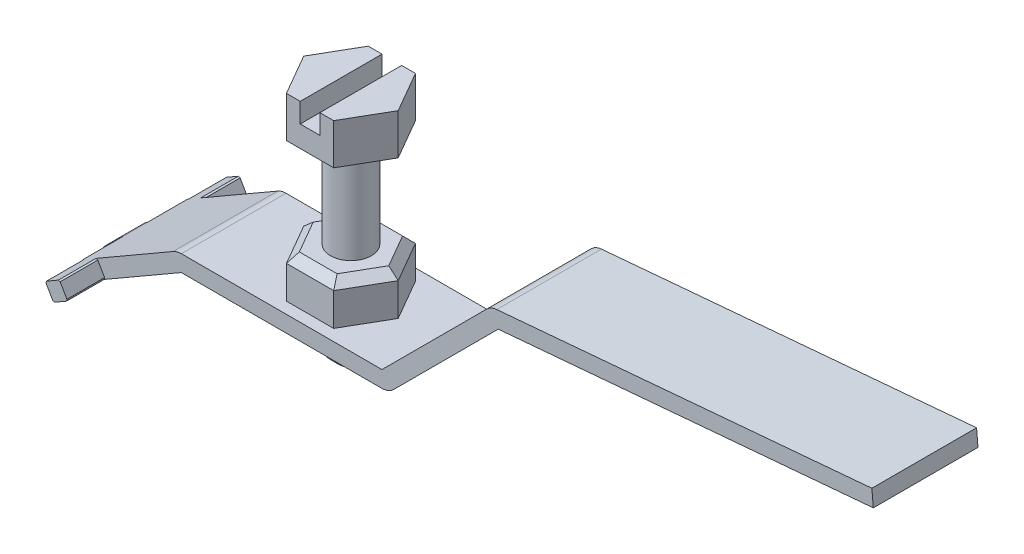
ISO-10303-21;
HEADER;
FILE_DESCRIPTION(('STEP AP214'),'2;1');
FILE_NAME('part.step','',(''),(''),'','','');
FILE_SCHEMA(('AUTOMOTIVE_DESIGN { 1 0 10303 214 1 1 1 1 }'));
ENDSEC;
DATA;
#1=APPLICATION_CONTEXT('core data for automotive mechanical design processes');
#2=APPLICATION_PROTOCOL_DEFINITION('international standard','automotive_design',2000,#1);
#3=PRODUCT_CONTEXT('',#1,'mechanical');
#4=PRODUCT('Part','Part','',(#3));
#5=PRODUCT_RELATED_PRODUCT_CATEGORY('part','',(#4));
#6=PRODUCT_DEFINITION_FORMATION('','',#4);
#7=PRODUCT_DEFINITION_CONTEXT('part definition',#1,'design');
#8=PRODUCT_DEFINITION('design','',#6,#7);
#9=PRODUCT_DEFINITION_SHAPE('','',#8);
#10=(LENGTH_UNIT() NAMED_UNIT(*) SI_UNIT(.MILLI.,.METRE.));
#11=(NAMED_UNIT(*) PLANE_ANGLE_UNIT() SI_UNIT($,.RADIAN.));
#12=(NAMED_UNIT(*) SI_UNIT($,.STERADIAN.) SOLID_ANGLE_UNIT());
#13=UNCERTAINTY_MEASURE_WITH_UNIT(LENGTH_MEASURE(1.E-05),#10,'distance_accuracy_value','');
#14=(GEOMETRIC_REPRESENTATION_CONTEXT(3) GLOBAL_UNCERTAINTY_ASSIGNED_CONTEXT((#13)) GLOBAL_UNIT_ASSIGNED_CONTEXT((#10,
#11,#12)) REPRESENTATION_CONTEXT('',''));
#15=CARTESIAN_POINT('',(0.,0.,0.));
#16=DIRECTION('',(0.,0.,1.));
#17=DIRECTION('',(1.,0.,0.));
#18=AXIS2_PLACEMENT_3D('',#15,#16,#17);
#19=CARTESIAN_POINT('',(13.9433756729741,14.5,-2.5));
#20=DIRECTION('',(0.,1.,0.));
#21=DIRECTION('',(0.,0.,1.));
#22=AXIS2_PLACEMENT_3D('',#19,#20,#21);
#23=PLANE('',#22);
#24=DIRECTION('',(0.,0.,1.));
#25=VECTOR('',#24,1.);
#26=CARTESIAN_POINT('',(11.9,14.5,-2.5));
#27=LINE('',#26,#25);
#28=CARTESIAN_POINT('',(11.9,14.5,-2.5));
#29=VERTEX_POINT('',#28);
#30=CARTESIAN_POINT('',(11.9,14.5,2.5));
#31=VERTEX_POINT('',#30);
#32=EDGE_CURVE('E54',#29,#31,#27,.T.);
#33=ORIENTED_EDGE('',*,*,#32,.F.);
#34=DIRECTION('',(-1.,0.,0.));
#35=VECTOR('',#34,1.);
#36=CARTESIAN_POINT('',(13.9433756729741,14.5,-2.5));
#37=LINE('',#36,#35);
#38=CARTESIAN_POINT('',(11.0566243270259,14.5,-2.5));
#39=VERTEX_POINT('',#38);
#40=EDGE_CURVE('E193',#29,#39,#37,.T.);
#41=ORIENTED_EDGE('',*,*,#40,.T.);
#42=DIRECTION('',(-0.5,0.,0.866025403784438));
#43=VECTOR('',#42,1.);
#44=CARTESIAN_POINT('',(11.0566243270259,14.5,-2.5));
#45=LINE('',#44,#43);
#46=CARTESIAN_POINT('',(9.61324865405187,14.5,0.));
#47=VERTEX_POINT('',#46);
#48=EDGE_CURVE('E125',#39,#47,#45,.T.);
#49=ORIENTED_EDGE('',*,*,#48,.T.);
#50=DIRECTION('',(0.5,0.,0.866025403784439));
#51=VECTOR('',#50,1.);
#52=CARTESIAN_POINT('',(9.61324865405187,14.5,0.));
#53=LINE('',#52,#51);
#54=CARTESIAN_POINT('',(11.0566243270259,14.5,2.5));
#55=VERTEX_POINT('',#54);
#56=EDGE_CURVE('E118',#47,#55,#53,.T.);
#57=ORIENTED_EDGE('',*,*,#56,.T.);
#58=DIRECTION('',(1.,0.,0.));
#59=VECTOR('',#58,1.);
#60=CARTESIAN_POINT('',(11.0566243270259,14.5,2.5));
#61=LINE('',#60,#59);
#62=EDGE_CURVE('E123',#55,#31,#61,.T.);
#63=ORIENTED_EDGE('',*,*,#62,.T.);
#64=EDGE_LOOP('',(#33,#41,#49,#57,#63));
#65=FACE_BOUND('',#64,.T.);
#66=ADVANCED_FACE('F46',(#65),#23,.T.);
#67=CARTESIAN_POINT('',(12.5,0.,0.));
#68=DIRECTION('',(0.,1.,0.));
#69=DIRECTION('',(0.,0.,1.));
#70=AXIS2_PLACEMENT_3D('',#67,#68,#69);
#71=CYLINDRICAL_SURFACE('',#70,1.25);
#72=CARTESIAN_POINT('',(12.5,0.5,0.));
#73=DIRECTION('',(0.,1.,0.));
#74=DIRECTION('',(0.,0.,1.));
#75=AXIS2_PLACEMENT_3D('',#72,#73,#74);
#76=CIRCLE('',#75,1.25);
#77=CARTESIAN_POINT('',(12.5,0.5,1.25));
#78=VERTEX_POINT('',#77);
#79=EDGE_CURVE('E174',#78,#78,#76,.T.);
#80=ORIENTED_EDGE('',*,*,#79,.T.);
#81=EDGE_LOOP('',(#80));
#82=FACE_BOUND('',#81,.T.);
#83=CARTESIAN_POINT('',(12.5,12.,0.));
#84=DIRECTION('',(0.,1.,0.));
#85=DIRECTION('',(0.,0.,1.));
#86=AXIS2_PLACEMENT_3D('',#83,#84,#85);
#87=CIRCLE('',#86,1.25);
#88=CARTESIAN_POINT('',(12.5,12.,1.25));
#89=VERTEX_POINT('',#88);
#90=EDGE_CURVE('E171',#89,#89,#87,.T.);
#91=ORIENTED_EDGE('',*,*,#90,.F.);
#92=EDGE_LOOP('',(#91));
#93=FACE_BOUND('',#92,.T.);
#94=ADVANCED_FACE('F238',(#82,#93),#71,.T.);
#95=CARTESIAN_POINT('',(12.5,0.,0.));
#96=DIRECTION('',(0.,1.,0.));
#97=DIRECTION('',(0.,0.,1.));
#98=AXIS2_PLACEMENT_3D('',#95,#96,#97);
#99=PLANE('',#98);
#100=CARTESIAN_POINT('',(12.5,0.,0.));
#101=DIRECTION('',(0.,1.,0.));
#102=DIRECTION('',(0.,0.,1.));
#103=AXIS2_PLACEMENT_3D('',#100,#101,#102);
#104=CIRCLE('',#103,0.749999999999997);
#105=CARTESIAN_POINT('',(12.5,0.,0.749999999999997));
#106=VERTEX_POINT('',#105);
#107=EDGE_CURVE('E177',#106,#106,#104,.F.);
#108=ORIENTED_EDGE('',*,*,#107,.T.);
#109=EDGE_LOOP('',(#108));
#110=FACE_BOUND('',#109,.T.);
#111=ADVANCED_FACE('F243',(#110),#99,.F.);
#112=CARTESIAN_POINT('',(12.5,0.5,0.));
#113=DIRECTION('',(0.,1.,0.));
#114=DIRECTION('',(0.,0.,1.));
#115=AXIS2_PLACEMENT_3D('',#112,#113,#114);
#116=CONICAL_SURFACE('',#115,1.25,0.785398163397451);
#117=ORIENTED_EDGE('',*,*,#107,.F.);
#118=EDGE_LOOP('',(#117));
#119=FACE_BOUND('',#118,.T.);
#120=ORIENTED_EDGE('',*,*,#79,.F.);
#121=EDGE_LOOP('',(#120));
#122=FACE_BOUND('',#121,.T.);
#123=ADVANCED_FACE('F48',(#119,#122),#116,.T.);
#124=CARTESIAN_POINT('',(15.3867513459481,14.5,0.));
#125=DIRECTION('',(-0.866025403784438,0.,0.5));
#126=DIRECTION('',(0.500000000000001,0.,0.866025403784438));
#127=AXIS2_PLACEMENT_3D('',#124,#125,#126);
#128=PLANE('',#127);
#129=DIRECTION('',(-0.5,0.,-0.866025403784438));
#130=VECTOR('',#129,1.);
#131=CARTESIAN_POINT('',(15.3867513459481,12.,0.));
#132=LINE('',#131,#130);
#133=CARTESIAN_POINT('',(15.3867513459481,12.,0.));
#134=VERTEX_POINT('',#133);
#135=CARTESIAN_POINT('',(13.9433756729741,12.,-2.5));
#136=VERTEX_POINT('',#135);
#137=EDGE_CURVE('E150',#134,#136,#132,.T.);
#138=ORIENTED_EDGE('',*,*,#137,.T.);
#139=DIRECTION('',(0.,-1.,0.));
#140=VECTOR('',#139,1.);
#141=CARTESIAN_POINT('',(13.9433756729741,14.5,-2.5));
#142=LINE('',#141,#140);
#143=CARTESIAN_POINT('',(13.9433756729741,14.5,-2.5));
#144=VERTEX_POINT('',#143);
#145=EDGE_CURVE('E169',#144,#136,#142,.T.);
#146=ORIENTED_EDGE('',*,*,#145,.F.);
#147=DIRECTION('',(-0.5,0.,-0.866025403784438));
#148=VECTOR('',#147,1.);
#149=CARTESIAN_POINT('',(15.3867513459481,14.5,0.));
#150=LINE('',#149,#148);
#151=CARTESIAN_POINT('',(15.3867513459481,14.5,0.));
#152=VERTEX_POINT('',#151);
#153=EDGE_CURVE('E162',#152,#144,#150,.T.);
#154=ORIENTED_EDGE('',*,*,#153,.F.);
#155=DIRECTION('',(0.,-1.,0.));
#156=VECTOR('',#155,1.);
#157=CARTESIAN_POINT('',(15.3867513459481,14.5,0.));
#158=LINE('',#157,#156);
#159=EDGE_CURVE('E146',#152,#134,#158,.T.);
#160=ORIENTED_EDGE('',*,*,#159,.T.);
#161=EDGE_LOOP('',(#138,#146,#154,#160));
#162=FACE_BOUND('',#161,.T.);
#163=ADVANCED_FACE('F264',(#162),#128,.F.);
#164=CARTESIAN_POINT('',(13.9433756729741,14.5,-2.5));
#165=DIRECTION('',(0.,0.,1.));
#166=DIRECTION('',(1.,0.,0.));
#167=AXIS2_PLACEMENT_3D('',#164,#165,#166);
#168=PLANE('',#167);
#169=ORIENTED_EDGE('',*,*,#40,.F.);
#170=DIRECTION('',(0.,-1.,0.));
#171=VECTOR('',#170,1.);
#172=CARTESIAN_POINT('',(11.9,14.5,-2.5));
#173=LINE('',#172,#171);
#174=CARTESIAN_POINT('',(11.9,13.3,-2.5));
#175=VERTEX_POINT('',#174);
#176=EDGE_CURVE('E189',#29,#175,#173,.T.);
#177=ORIENTED_EDGE('',*,*,#176,.T.);
#178=DIRECTION('',(1.,0.,0.));
#179=VECTOR('',#178,1.);
#180=CARTESIAN_POINT('',(13.9433756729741,13.3,-2.5));
#181=LINE('',#180,#179);
#182=CARTESIAN_POINT('',(13.1,13.3,-2.5));
#183=VERTEX_POINT('',#182);
#184=EDGE_CURVE('E154',#175,#183,#181,.T.);
#185=ORIENTED_EDGE('',*,*,#184,.T.);
#186=DIRECTION('',(0.,1.,0.));
#187=VECTOR('',#186,1.);
#188=CARTESIAN_POINT('',(13.1,14.5,-2.5));
#189=LINE('',#188,#187);
#190=CARTESIAN_POINT('',(13.1,14.5,-2.5));
#191=VERTEX_POINT('',#190);
#192=EDGE_CURVE('E205',#183,#191,#189,.T.);
#193=ORIENTED_EDGE('',*,*,#192,.T.);
#194=EDGE_CURVE('E106',#144,#191,#37,.T.);
#195=ORIENTED_EDGE('',*,*,#194,.F.);
#196=ORIENTED_EDGE('',*,*,#145,.T.);
#197=DIRECTION('',(-1.,0.,0.));
#198=VECTOR('',#197,1.);
#199=CARTESIAN_POINT('',(13.9433756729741,12.,-2.5));
#200=LINE('',#199,#198);
#201=CARTESIAN_POINT('',(11.0566243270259,12.,-2.5));
#202=VERTEX_POINT('',#201);
#203=EDGE_CURVE('E153',#136,#202,#200,.T.);
#204=ORIENTED_EDGE('',*,*,#203,.T.);
#205=DIRECTION('',(0.,-1.,0.));
#206=VECTOR('',#205,1.);
#207=CARTESIAN_POINT('',(11.0566243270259,14.5,-2.5));
#208=LINE('',#207,#206);
#209=EDGE_CURVE('E166',#39,#202,#208,.T.);
#210=ORIENTED_EDGE('',*,*,#209,.F.);
#211=EDGE_LOOP('',(#169,#177,#185,#193,#195,#196,#204,#210));
#212=FACE_BOUND('',#211,.T.);
#213=ADVANCED_FACE('F197',(#212),#168,.F.);
#214=CARTESIAN_POINT('',(11.0566243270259,14.5,-2.5));
#215=DIRECTION('',(0.866025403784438,0.,0.5));
#216=DIRECTION('',(0.5,0.,-0.866025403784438));
#217=AXIS2_PLACEMENT_3D('',#214,#215,#216);
#218=PLANE('',#217);
#219=DIRECTION('',(-0.5,0.,0.866025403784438));
#220=VECTOR('',#219,1.);
#221=CARTESIAN_POINT('',(11.0566243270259,12.,-2.5));
#222=LINE('',#221,#220);
#223=CARTESIAN_POINT('',(9.61324865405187,12.,0.));
#224=VERTEX_POINT('',#223);
#225=EDGE_CURVE('E156',#202,#224,#222,.T.);
#226=ORIENTED_EDGE('',*,*,#225,.T.);
#227=DIRECTION('',(0.,-1.,0.));
#228=VECTOR('',#227,1.);
#229=CARTESIAN_POINT('',(9.61324865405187,14.5,0.));
#230=LINE('',#229,#228);
#231=EDGE_CURVE('E138',#47,#224,#230,.T.);
#232=ORIENTED_EDGE('',*,*,#231,.F.);
#233=ORIENTED_EDGE('',*,*,#48,.F.);
#234=ORIENTED_EDGE('',*,*,#209,.T.);
#235=EDGE_LOOP('',(#226,#232,#233,#234));
#236=FACE_BOUND('',#235,.T.);
#237=ADVANCED_FACE('F258',(#236),#218,.F.);
#238=CARTESIAN_POINT('',(9.61324865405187,14.5,0.));
#239=DIRECTION('',(0.866025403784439,0.,-0.5));
#240=DIRECTION('',(-0.5,0.,-0.866025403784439));
#241=AXIS2_PLACEMENT_3D('',#238,#239,#240);
#242=PLANE('',#241);
#243=DIRECTION('',(0.5,0.,0.866025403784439));
#244=VECTOR('',#243,1.);
#245=CARTESIAN_POINT('',(9.61324865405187,12.,0.));
#246=LINE('',#245,#244);
#247=CARTESIAN_POINT('',(11.0566243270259,12.,2.5));
#248=VERTEX_POINT('',#247);
#249=EDGE_CURVE('E135',#224,#248,#246,.T.);
#250=ORIENTED_EDGE('',*,*,#249,.T.);
#251=DIRECTION('',(0.,-1.,0.));
#252=VECTOR('',#251,1.);
#253=CARTESIAN_POINT('',(11.0566243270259,14.5,2.5));
#254=LINE('',#253,#252);
#255=EDGE_CURVE('E132',#55,#248,#254,.T.);
#256=ORIENTED_EDGE('',*,*,#255,.F.);
#257=ORIENTED_EDGE('',*,*,#56,.F.);
#258=ORIENTED_EDGE('',*,*,#231,.T.);
#259=EDGE_LOOP('',(#250,#256,#257,#258));
#260=FACE_BOUND('',#259,.T.);
#261=ADVANCED_FACE('F133',(#260),#242,.F.);
#262=CARTESIAN_POINT('',(11.0566243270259,14.5,2.5));
#263=DIRECTION('',(0.,0.,-1.));
#264=DIRECTION('',(-1.,0.,0.));
#265=AXIS2_PLACEMENT_3D('',#262,#263,#264);
#266=PLANE('',#265);
#267=DIRECTION('',(-1.,0.,0.));
#268=VECTOR('',#267,1.);
#269=CARTESIAN_POINT('',(11.0566243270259,13.3,2.5));
#270=LINE('',#269,#268);
#271=CARTESIAN_POINT('',(13.1,13.3,2.5));
#272=VERTEX_POINT('',#271);
#273=CARTESIAN_POINT('',(11.9,13.3,2.5));
#274=VERTEX_POINT('',#273);
#275=EDGE_CURVE('E13',#272,#274,#270,.T.);
#276=ORIENTED_EDGE('',*,*,#275,.T.);
#277=DIRECTION('',(0.,1.,0.));
#278=VECTOR('',#277,1.);
#279=CARTESIAN_POINT('',(11.9,14.5,2.5));
#280=LINE('',#279,#278);
#281=EDGE_CURVE('E144',#274,#31,#280,.T.);
#282=ORIENTED_EDGE('',*,*,#281,.T.);
#283=ORIENTED_EDGE('',*,*,#62,.F.);
#284=ORIENTED_EDGE('',*,*,#255,.T.);
#285=DIRECTION('',(1.,0.,0.));
#286=VECTOR('',#285,1.);
#287=CARTESIAN_POINT('',(11.0566243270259,12.,2.5));
#288=LINE('',#287,#286);
#289=CARTESIAN_POINT('',(13.9433756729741,12.,2.5));
#290=VERTEX_POINT('',#289);
#291=EDGE_CURVE('E159',#248,#290,#288,.T.);
#292=ORIENTED_EDGE('',*,*,#291,.T.);
#293=DIRECTION('',(0.,-1.,0.));
#294=VECTOR('',#293,1.);
#295=CARTESIAN_POINT('',(13.9433756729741,14.5,2.5));
#296=LINE('',#295,#294);
#297=CARTESIAN_POINT('',(13.9433756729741,14.5,2.5));
#298=VERTEX_POINT('',#297);
#299=EDGE_CURVE('E139',#298,#290,#296,.T.);
#300=ORIENTED_EDGE('',*,*,#299,.F.);
#301=CARTESIAN_POINT('',(13.1,14.5,2.5));
#302=VERTEX_POINT('',#301);
#303=EDGE_CURVE('E129',#302,#298,#61,.T.);
#304=ORIENTED_EDGE('',*,*,#303,.F.);
#305=DIRECTION('',(0.,-1.,0.));
#306=VECTOR('',#305,1.);
#307=CARTESIAN_POINT('',(13.1,14.5,2.5));
#308=LINE('',#307,#306);
#309=EDGE_CURVE('E61',#302,#272,#308,.T.);
#310=ORIENTED_EDGE('',*,*,#309,.T.);
#311=EDGE_LOOP('',(#276,#282,#283,#284,#292,#300,#304,#310));
#312=FACE_BOUND('',#311,.T.);
#313=ADVANCED_FACE('F142',(#312),#266,.F.);
#314=CARTESIAN_POINT('',(13.9433756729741,14.5,2.5));
#315=DIRECTION('',(-0.866025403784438,0.,-0.5));
#316=DIRECTION('',(-0.5,0.,0.866025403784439));
#317=AXIS2_PLACEMENT_3D('',#314,#315,#316);
#318=PLANE('',#317);
#319=DIRECTION('',(0.5,0.,-0.866025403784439));
#320=VECTOR('',#319,1.);
#321=CARTESIAN_POINT('',(13.9433756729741,12.,2.5));
#322=LINE('',#321,#320);
#323=EDGE_CURVE('E97',#290,#134,#322,.T.);
#324=ORIENTED_EDGE('',*,*,#323,.T.);
#325=ORIENTED_EDGE('',*,*,#159,.F.);
#326=DIRECTION('',(0.5,0.,-0.866025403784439));
#327=VECTOR('',#326,1.);
#328=CARTESIAN_POINT('',(13.9433756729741,14.5,2.5));
#329=LINE('',#328,#327);
#330=EDGE_CURVE('E70',#298,#152,#329,.T.);
#331=ORIENTED_EDGE('',*,*,#330,.F.);
#332=ORIENTED_EDGE('',*,*,#299,.T.);
#333=EDGE_LOOP('',(#324,#325,#331,#332));
#334=FACE_BOUND('',#333,.T.);
#335=ADVANCED_FACE('F246',(#334),#318,.F.);
#336=DIRECTION('',(0.,0.,-1.));
#337=VECTOR('',#336,1.);
#338=CARTESIAN_POINT('',(13.1,14.5,-2.5));
#339=LINE('',#338,#337);
#340=EDGE_CURVE('E180',#302,#191,#339,.T.);
#341=ORIENTED_EDGE('',*,*,#340,.F.);
#342=ORIENTED_EDGE('',*,*,#303,.T.);
#343=ORIENTED_EDGE('',*,*,#330,.T.);
#344=ORIENTED_EDGE('',*,*,#153,.T.);
#345=ORIENTED_EDGE('',*,*,#194,.T.);
#346=EDGE_LOOP('',(#341,#342,#343,#344,#345));
#347=FACE_BOUND('',#346,.T.);
#348=ADVANCED_FACE('F222',(#347),#23,.T.);
#349=CARTESIAN_POINT('',(13.9433756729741,12.,-2.5));
#350=DIRECTION('',(0.,1.,0.));
#351=DIRECTION('',(0.,0.,1.));
#352=AXIS2_PLACEMENT_3D('',#349,#350,#351);
#353=PLANE('',#352);
#354=ORIENTED_EDGE('',*,*,#90,.T.);
#355=EDGE_LOOP('',(#354));
#356=FACE_BOUND('',#355,.T.);
#357=ORIENTED_EDGE('',*,*,#137,.F.);
#358=ORIENTED_EDGE('',*,*,#323,.F.);
#359=ORIENTED_EDGE('',*,*,#291,.F.);
#360=ORIENTED_EDGE('',*,*,#249,.F.);
#361=ORIENTED_EDGE('',*,*,#225,.F.);
#362=ORIENTED_EDGE('',*,*,#203,.F.);
#363=EDGE_LOOP('',(#357,#358,#359,#360,#361,#362));
#364=FACE_BOUND('',#363,.T.);
#365=ADVANCED_FACE('F227',(#356,#364),#353,.F.);
#366=CARTESIAN_POINT('',(11.9,13.3,-5.));
#367=DIRECTION('',(0.,-1.,0.));
#368=DIRECTION('',(0.,0.,-1.));
#369=AXIS2_PLACEMENT_3D('',#366,#367,#368);
#370=PLANE('',#369);
#371=DIRECTION('',(0.,0.,1.));
#372=VECTOR('',#371,1.);
#373=CARTESIAN_POINT('',(11.9,13.3,-5.));
#374=LINE('',#373,#372);
#375=EDGE_CURVE('E209',#175,#274,#374,.T.);
#376=ORIENTED_EDGE('',*,*,#375,.T.);
#377=ORIENTED_EDGE('',*,*,#275,.F.);
#378=DIRECTION('',(0.,0.,1.));
#379=VECTOR('',#378,1.);
#380=CARTESIAN_POINT('',(13.1,13.3,-5.));
#381=LINE('',#380,#379);
#382=EDGE_CURVE('E208',#183,#272,#381,.T.);
#383=ORIENTED_EDGE('',*,*,#382,.F.);
#384=ORIENTED_EDGE('',*,*,#184,.F.);
#385=EDGE_LOOP('',(#376,#377,#383,#384));
#386=FACE_BOUND('',#385,.T.);
#387=ADVANCED_FACE('F225',(#386),#370,.F.);
#388=CARTESIAN_POINT('',(11.9,14.5,-5.));
#389=DIRECTION('',(-1.,0.,0.));
#390=DIRECTION('',(0.,0.,1.));
#391=AXIS2_PLACEMENT_3D('',#388,#389,#390);
#392=PLANE('',#391);
#393=ORIENTED_EDGE('',*,*,#32,.T.);
#394=ORIENTED_EDGE('',*,*,#281,.F.);
#395=ORIENTED_EDGE('',*,*,#375,.F.);
#396=ORIENTED_EDGE('',*,*,#176,.F.);
#397=EDGE_LOOP('',(#393,#394,#395,#396));
#398=FACE_BOUND('',#397,.T.);
#399=ADVANCED_FACE('F184',(#398),#392,.F.);
#400=CARTESIAN_POINT('',(13.1,13.3,-5.));
#401=DIRECTION('',(1.,0.,0.));
#402=DIRECTION('',(0.,0.,-1.));
#403=AXIS2_PLACEMENT_3D('',#400,#401,#402);
#404=PLANE('',#403);
#405=ORIENTED_EDGE('',*,*,#382,.T.);
#406=ORIENTED_EDGE('',*,*,#309,.F.);
#407=ORIENTED_EDGE('',*,*,#340,.T.);
#408=ORIENTED_EDGE('',*,*,#192,.F.);
#409=EDGE_LOOP('',(#405,#406,#407,#408));
#410=FACE_BOUND('',#409,.T.);
#411=ADVANCED_FACE('F214',(#410),#404,.F.);
#412=CLOSED_SHELL('',(#66,#94,#111,#123,#163,#213,#237,#261,#313,#335,#348,#365,#387,#399,#411));
#413=MANIFOLD_SOLID_BREP('B2',#412);
#414=CARTESIAN_POINT('',(15.3867513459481,6.,0.));
#415=DIRECTION('',(0.,1.,0.));
#416=DIRECTION('',(0.,0.,1.));
#417=AXIS2_PLACEMENT_3D('',#414,#415,#416);
#418=PLANE('',#417);
#419=DIRECTION('',(-1.,0.,0.));
#420=VECTOR('',#419,1.);
#421=CARTESIAN_POINT('',(11.0566243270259,6.,-2.));
#422=LINE('',#421,#420);
#423=CARTESIAN_POINT('',(13.6547005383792,6.,-2.));
#424=VERTEX_POINT('',#423);
#425=CARTESIAN_POINT('',(11.3452994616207,6.,-2.));
#426=VERTEX_POINT('',#425);
#427=EDGE_CURVE('E504',#424,#426,#422,.T.);
#428=ORIENTED_EDGE('',*,*,#427,.T.);
#429=DIRECTION('',(-0.5,0.,0.866025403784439));
#430=VECTOR('',#429,1.);
#431=CARTESIAN_POINT('',(10.0462613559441,6.,0.25));
#432=LINE('',#431,#430);
#433=CARTESIAN_POINT('',(10.1905989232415,6.,0.));
#434=VERTEX_POINT('',#433);
#435=EDGE_CURVE('E506',#426,#434,#432,.T.);
#436=ORIENTED_EDGE('',*,*,#435,.T.);
#437=DIRECTION('',(0.5,0.,0.866025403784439));
#438=VECTOR('',#437,1.);
#439=CARTESIAN_POINT('',(11.4896370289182,6.,2.25));
#440=LINE('',#439,#438);
#441=CARTESIAN_POINT('',(11.3452994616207,6.,2.));
#442=VERTEX_POINT('',#441);
#443=EDGE_CURVE('E457',#434,#442,#440,.T.);
#444=ORIENTED_EDGE('',*,*,#443,.T.);
#445=DIRECTION('',(1.,0.,0.));
#446=VECTOR('',#445,1.);
#447=CARTESIAN_POINT('',(13.9433756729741,6.,2.));
#448=LINE('',#447,#446);
#449=CARTESIAN_POINT('',(13.6547005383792,6.,2.));
#450=VERTEX_POINT('',#449);
#451=EDGE_CURVE('E498',#442,#450,#448,.T.);
#452=ORIENTED_EDGE('',*,*,#451,.T.);
#453=DIRECTION('',(0.5,0.,-0.866025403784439));
#454=VECTOR('',#453,1.);
#455=CARTESIAN_POINT('',(14.9537386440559,6.,-0.250000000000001));
#456=LINE('',#455,#454);
#457=CARTESIAN_POINT('',(14.8094010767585,6.,0.));
#458=VERTEX_POINT('',#457);
#459=EDGE_CURVE('E500',#450,#458,#456,.T.);
#460=ORIENTED_EDGE('',*,*,#459,.T.);
#461=DIRECTION('',(-0.5,0.,-0.866025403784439));
#462=VECTOR('',#461,1.);
#463=CARTESIAN_POINT('',(13.5103629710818,6.,-2.25));
#464=LINE('',#463,#462);
#465=EDGE_CURVE('E502',#458,#424,#464,.T.);
#466=ORIENTED_EDGE('',*,*,#465,.T.);
#467=EDGE_LOOP('',(#428,#436,#444,#452,#460,#466));
#468=FACE_BOUND('',#467,.T.);
#469=CARTESIAN_POINT('',(12.5,6.,0.));
#470=DIRECTION('',(0.,1.,0.));
#471=DIRECTION('',(0.,0.,1.));
#472=AXIS2_PLACEMENT_3D('',#469,#470,#471);
#473=CIRCLE('',#472,1.);
#474=CARTESIAN_POINT('',(12.5,6.,1.));
#475=VERTEX_POINT('',#474);
#476=EDGE_CURVE('E473',#475,#475,#473,.T.);
#477=ORIENTED_EDGE('',*,*,#476,.F.);
#478=EDGE_LOOP('',(#477));
#479=FACE_BOUND('',#478,.T.);
#480=ADVANCED_FACE('F377',(#468,#479),#418,.T.);
#481=CARTESIAN_POINT('',(15.3867513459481,3.5,0.));
#482=DIRECTION('',(0.,1.,0.));
#483=DIRECTION('',(0.,0.,1.));
#484=AXIS2_PLACEMENT_3D('',#481,#482,#483);
#485=PLANE('',#484);
#486=DIRECTION('',(0.5,0.,-0.866025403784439));
#487=VECTOR('',#486,1.);
#488=CARTESIAN_POINT('',(13.9433756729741,3.5,2.5));
#489=LINE('',#488,#487);
#490=CARTESIAN_POINT('',(13.9433756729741,3.5,2.5));
#491=VERTEX_POINT('',#490);
#492=CARTESIAN_POINT('',(15.3867513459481,3.5,0.));
#493=VERTEX_POINT('',#492);
#494=EDGE_CURVE('E465',#491,#493,#489,.T.);
#495=ORIENTED_EDGE('',*,*,#494,.F.);
#496=DIRECTION('',(1.,0.,0.));
#497=VECTOR('',#496,1.);
#498=CARTESIAN_POINT('',(11.0566243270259,3.5,2.5));
#499=LINE('',#498,#497);
#500=CARTESIAN_POINT('',(11.0566243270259,3.5,2.5));
#501=VERTEX_POINT('',#500);
#502=EDGE_CURVE('E487',#501,#491,#499,.T.);
#503=ORIENTED_EDGE('',*,*,#502,.F.);
#504=DIRECTION('',(0.5,0.,0.866025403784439));
#505=VECTOR('',#504,1.);
#506=CARTESIAN_POINT('',(9.61324865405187,3.5,0.));
#507=LINE('',#506,#505);
#508=CARTESIAN_POINT('',(9.61324865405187,3.5,0.));
#509=VERTEX_POINT('',#508);
#510=EDGE_CURVE('E484',#509,#501,#507,.T.);
#511=ORIENTED_EDGE('',*,*,#510,.F.);
#512=DIRECTION('',(-0.5,0.,0.866025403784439));
#513=VECTOR('',#512,1.);
#514=CARTESIAN_POINT('',(11.0566243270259,3.5,-2.5));
#515=LINE('',#514,#513);
#516=CARTESIAN_POINT('',(11.0566243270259,3.5,-2.5));
#517=VERTEX_POINT('',#516);
#518=EDGE_CURVE('E481',#517,#509,#515,.T.);
#519=ORIENTED_EDGE('',*,*,#518,.F.);
#520=DIRECTION('',(-1.,0.,0.));
#521=VECTOR('',#520,1.);
#522=CARTESIAN_POINT('',(13.9433756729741,3.5,-2.5));
#523=LINE('',#522,#521);
#524=CARTESIAN_POINT('',(13.9433756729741,3.5,-2.5));
#525=VERTEX_POINT('',#524);
#526=EDGE_CURVE('E468',#525,#517,#523,.T.);
#527=ORIENTED_EDGE('',*,*,#526,.F.);
#528=DIRECTION('',(-0.5,0.,-0.866025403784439));
#529=VECTOR('',#528,1.);
#530=CARTESIAN_POINT('',(15.3867513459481,3.5,0.));
#531=LINE('',#530,#529);
#532=EDGE_CURVE('E452',#493,#525,#531,.T.);
#533=ORIENTED_EDGE('',*,*,#532,.F.);
#534=EDGE_LOOP('',(#495,#503,#511,#519,#527,#533));
#535=FACE_BOUND('',#534,.T.);
#536=CARTESIAN_POINT('',(12.5,3.5,0.));
#537=DIRECTION('',(0.,1.,0.));
#538=DIRECTION('',(0.,0.,1.));
#539=AXIS2_PLACEMENT_3D('',#536,#537,#538);
#540=CIRCLE('',#539,1.);
#541=CARTESIAN_POINT('',(12.5,3.5,1.));
#542=VERTEX_POINT('',#541);
#543=EDGE_CURVE('E476',#542,#542,#540,.T.);
#544=ORIENTED_EDGE('',*,*,#543,.T.);
#545=EDGE_LOOP('',(#544));
#546=FACE_BOUND('',#545,.T.);
#547=ADVANCED_FACE('F462',(#535,#546),#485,.F.);
#548=CARTESIAN_POINT('',(13.9433756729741,6.,2.5));
#549=DIRECTION('',(-0.866025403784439,0.,-0.5));
#550=DIRECTION('',(-0.5,0.,0.866025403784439));
#551=AXIS2_PLACEMENT_3D('',#548,#549,#550);
#552=PLANE('',#551);
#553=DIRECTION('',(0.,-1.,0.));
#554=VECTOR('',#553,1.);
#555=CARTESIAN_POINT('',(15.3867513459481,6.,0.));
#556=LINE('',#555,#554);
#557=CARTESIAN_POINT('',(15.3867513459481,5.5,0.));
#558=VERTEX_POINT('',#557);
#559=EDGE_CURVE('E448',#558,#493,#556,.T.);
#560=ORIENTED_EDGE('',*,*,#559,.F.);
#561=DIRECTION('',(-0.5,0.,0.866025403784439));
#562=VECTOR('',#561,1.);
#563=CARTESIAN_POINT('',(13.9433756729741,5.5,2.5));
#564=LINE('',#563,#562);
#565=CARTESIAN_POINT('',(13.9433756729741,5.5,2.5));
#566=VERTEX_POINT('',#565);
#567=EDGE_CURVE('E401',#558,#566,#564,.T.);
#568=ORIENTED_EDGE('',*,*,#567,.T.);
#569=DIRECTION('',(0.,-1.,0.));
#570=VECTOR('',#569,1.);
#571=CARTESIAN_POINT('',(13.9433756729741,6.,2.5));
#572=LINE('',#571,#570);
#573=EDGE_CURVE('E471',#566,#491,#572,.T.);
#574=ORIENTED_EDGE('',*,*,#573,.T.);
#575=ORIENTED_EDGE('',*,*,#494,.T.);
#576=EDGE_LOOP('',(#560,#568,#574,#575));
#577=FACE_BOUND('',#576,.T.);
#578=ADVANCED_FACE('F470',(#577),#552,.F.);
#579=CARTESIAN_POINT('',(15.3867513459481,6.,0.));
#580=DIRECTION('',(-0.866025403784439,0.,0.5));
#581=DIRECTION('',(0.5,0.,0.866025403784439));
#582=AXIS2_PLACEMENT_3D('',#579,#580,#581);
#583=PLANE('',#582);
#584=DIRECTION('',(0.,-1.,0.));
#585=VECTOR('',#584,1.);
#586=CARTESIAN_POINT('',(13.9433756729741,6.,-2.5));
#587=LINE('',#586,#585);
#588=CARTESIAN_POINT('',(13.9433756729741,5.5,-2.5));
#589=VERTEX_POINT('',#588);
#590=EDGE_CURVE('E458',#589,#525,#587,.T.);
#591=ORIENTED_EDGE('',*,*,#590,.F.);
#592=DIRECTION('',(0.5,0.,0.866025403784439));
#593=VECTOR('',#592,1.);
#594=CARTESIAN_POINT('',(15.3867513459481,5.5,0.));
#595=LINE('',#594,#593);
#596=EDGE_CURVE('E455',#589,#558,#595,.T.);
#597=ORIENTED_EDGE('',*,*,#596,.T.);
#598=ORIENTED_EDGE('',*,*,#559,.T.);
#599=ORIENTED_EDGE('',*,*,#532,.T.);
#600=EDGE_LOOP('',(#591,#597,#598,#599));
#601=FACE_BOUND('',#600,.T.);
#602=ADVANCED_FACE('F451',(#601),#583,.F.);
#603=CARTESIAN_POINT('',(13.9433756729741,6.,-2.5));
#604=DIRECTION('',(0.,0.,1.));
#605=DIRECTION('',(1.,0.,0.));
#606=AXIS2_PLACEMENT_3D('',#603,#604,#605);
#607=PLANE('',#606);
#608=DIRECTION('',(0.,-1.,0.));
#609=VECTOR('',#608,1.);
#610=CARTESIAN_POINT('',(11.0566243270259,6.,-2.5));
#611=LINE('',#610,#609);
#612=CARTESIAN_POINT('',(11.0566243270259,5.5,-2.5));
#613=VERTEX_POINT('',#612);
#614=EDGE_CURVE('E494',#613,#517,#611,.T.);
#615=ORIENTED_EDGE('',*,*,#614,.F.);
#616=DIRECTION('',(1.,0.,0.));
#617=VECTOR('',#616,1.);
#618=CARTESIAN_POINT('',(13.9433756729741,5.5,-2.5));
#619=LINE('',#618,#617);
#620=EDGE_CURVE('E512',#613,#589,#619,.T.);
#621=ORIENTED_EDGE('',*,*,#620,.T.);
#622=ORIENTED_EDGE('',*,*,#590,.T.);
#623=ORIENTED_EDGE('',*,*,#526,.T.);
#624=EDGE_LOOP('',(#615,#621,#622,#623));
#625=FACE_BOUND('',#624,.T.);
#626=ADVANCED_FACE('F566',(#625),#607,.F.);
#627=CARTESIAN_POINT('',(11.0566243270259,6.,-2.5));
#628=DIRECTION('',(0.866025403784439,0.,0.5));
#629=DIRECTION('',(0.5,0.,-0.866025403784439));
#630=AXIS2_PLACEMENT_3D('',#627,#628,#629);
#631=PLANE('',#630);
#632=DIRECTION('',(0.,-1.,0.));
#633=VECTOR('',#632,1.);
#634=CARTESIAN_POINT('',(9.61324865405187,6.,0.));
#635=LINE('',#634,#633);
#636=CARTESIAN_POINT('',(9.61324865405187,5.5,0.));
#637=VERTEX_POINT('',#636);
#638=EDGE_CURVE('E492',#637,#509,#635,.T.);
#639=ORIENTED_EDGE('',*,*,#638,.F.);
#640=DIRECTION('',(0.5,0.,-0.866025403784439));
#641=VECTOR('',#640,1.);
#642=CARTESIAN_POINT('',(11.0566243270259,5.5,-2.5));
#643=LINE('',#642,#641);
#644=EDGE_CURVE('E509',#637,#613,#643,.T.);
#645=ORIENTED_EDGE('',*,*,#644,.T.);
#646=ORIENTED_EDGE('',*,*,#614,.T.);
#647=ORIENTED_EDGE('',*,*,#518,.T.);
#648=EDGE_LOOP('',(#639,#645,#646,#647));
#649=FACE_BOUND('',#648,.T.);
#650=ADVANCED_FACE('F562',(#649),#631,.F.);
#651=CARTESIAN_POINT('',(9.61324865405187,6.,0.));
#652=DIRECTION('',(0.866025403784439,0.,-0.5));
#653=DIRECTION('',(-0.5,0.,-0.866025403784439));
#654=AXIS2_PLACEMENT_3D('',#651,#652,#653);
#655=PLANE('',#654);
#656=DIRECTION('',(0.,-1.,0.));
#657=VECTOR('',#656,1.);
#658=CARTESIAN_POINT('',(11.0566243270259,6.,2.5));
#659=LINE('',#658,#657);
#660=CARTESIAN_POINT('',(11.0566243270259,5.5,2.5));
#661=VERTEX_POINT('',#660);
#662=EDGE_CURVE('E490',#661,#501,#659,.T.);
#663=ORIENTED_EDGE('',*,*,#662,.F.);
#664=DIRECTION('',(-0.5,0.,-0.866025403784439));
#665=VECTOR('',#664,1.);
#666=CARTESIAN_POINT('',(9.61324865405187,5.5,0.));
#667=LINE('',#666,#665);
#668=EDGE_CURVE('E44',#661,#637,#667,.T.);
#669=ORIENTED_EDGE('',*,*,#668,.T.);
#670=ORIENTED_EDGE('',*,*,#638,.T.);
#671=ORIENTED_EDGE('',*,*,#510,.T.);
#672=EDGE_LOOP('',(#663,#669,#670,#671));
#673=FACE_BOUND('',#672,.T.);
#674=ADVANCED_FACE('F549',(#673),#655,.F.);
#675=CARTESIAN_POINT('',(11.0566243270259,6.,2.5));
#676=DIRECTION('',(0.,0.,-1.));
#677=DIRECTION('',(-1.,0.,0.));
#678=AXIS2_PLACEMENT_3D('',#675,#676,#677);
#679=PLANE('',#678);
#680=ORIENTED_EDGE('',*,*,#573,.F.);
#681=DIRECTION('',(-1.,0.,0.));
#682=VECTOR('',#681,1.);
#683=CARTESIAN_POINT('',(11.0566243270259,5.5,2.5));
#684=LINE('',#683,#682);
#685=EDGE_CURVE('E386',#566,#661,#684,.T.);
#686=ORIENTED_EDGE('',*,*,#685,.T.);
#687=ORIENTED_EDGE('',*,*,#662,.T.);
#688=ORIENTED_EDGE('',*,*,#502,.T.);
#689=EDGE_LOOP('',(#680,#686,#687,#688));
#690=FACE_BOUND('',#689,.T.);
#691=ADVANCED_FACE('F540',(#690),#679,.F.);
#692=CARTESIAN_POINT('',(12.5,6.,0.));
#693=DIRECTION('',(0.,-1.,0.));
#694=DIRECTION('',(0.,0.,-1.));
#695=AXIS2_PLACEMENT_3D('',#692,#693,#694);
#696=CYLINDRICAL_SURFACE('',#695,1.);
#697=ORIENTED_EDGE('',*,*,#476,.T.);
#698=EDGE_LOOP('',(#697));
#699=FACE_BOUND('',#698,.T.);
#700=ORIENTED_EDGE('',*,*,#543,.F.);
#701=EDGE_LOOP('',(#700));
#702=FACE_BOUND('',#701,.T.);
#703=ADVANCED_FACE('F538',(#699,#702),#696,.F.);
#704=CARTESIAN_POINT('',(14.9537386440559,6.,-0.25));
#705=DIRECTION('',(0.612372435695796,0.707106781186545,0.353553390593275));
#706=DIRECTION('',(-0.755928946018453,0.65465367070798,0.));
#707=AXIS2_PLACEMENT_3D('',#704,#705,#706);
#708=PLANE('',#707);
#709=DIRECTION('',(-0.377964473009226,0.654653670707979,-0.654653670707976));
#710=VECTOR('',#709,1.);
#711=CARTESIAN_POINT('',(13.9021363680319,5.57142857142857,2.42857142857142));
#712=LINE('',#711,#710);
#713=EDGE_CURVE('E526',#566,#450,#712,.T.);
#714=ORIENTED_EDGE('',*,*,#713,.F.);
#715=ORIENTED_EDGE('',*,*,#567,.F.);
#716=DIRECTION('',(-0.755928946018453,0.654653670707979,0.));
#717=VECTOR('',#716,1.);
#718=CARTESIAN_POINT('',(14.8918796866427,5.92857142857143,0.));
#719=LINE('',#718,#717);
#720=EDGE_CURVE('E381',#458,#558,#719,.F.);
#721=ORIENTED_EDGE('',*,*,#720,.F.);
#722=ORIENTED_EDGE('',*,*,#459,.F.);
#723=EDGE_LOOP('',(#714,#715,#721,#722));
#724=FACE_BOUND('',#723,.T.);
#725=ADVANCED_FACE('F379',(#724),#708,.T.);
#726=CARTESIAN_POINT('',(14.9537386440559,6.,0.25));
#727=DIRECTION('',(0.612372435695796,0.707106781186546,-0.353553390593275));
#728=DIRECTION('',(-0.755928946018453,0.654653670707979,0.));
#729=AXIS2_PLACEMENT_3D('',#726,#727,#728);
#730=PLANE('',#729);
#731=ORIENTED_EDGE('',*,*,#720,.T.);
#732=ORIENTED_EDGE('',*,*,#596,.F.);
#733=DIRECTION('',(-0.377964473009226,0.654653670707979,0.654653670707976));
#734=VECTOR('',#733,1.);
#735=CARTESIAN_POINT('',(13.2835467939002,6.64285714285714,-1.35714285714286));
#736=LINE('',#735,#734);
#737=EDGE_CURVE('E524',#424,#589,#736,.F.);
#738=ORIENTED_EDGE('',*,*,#737,.F.);
#739=ORIENTED_EDGE('',*,*,#465,.F.);
#740=EDGE_LOOP('',(#731,#732,#738,#739));
#741=FACE_BOUND('',#740,.T.);
#742=ADVANCED_FACE('F547',(#741),#730,.T.);
#743=CARTESIAN_POINT('',(15.3867513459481,6.,2.));
#744=DIRECTION('',(0.,0.707106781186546,0.707106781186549));
#745=DIRECTION('',(0.,-0.707106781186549,0.707106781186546));
#746=AXIS2_PLACEMENT_3D('',#743,#744,#745);
#747=PLANE('',#746);
#748=ORIENTED_EDGE('',*,*,#713,.T.);
#749=ORIENTED_EDGE('',*,*,#451,.F.);
#750=DIRECTION('',(0.377964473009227,0.654653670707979,-0.654653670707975));
#751=VECTOR('',#750,1.);
#752=CARTESIAN_POINT('',(11.3040601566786,5.92857142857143,2.07142857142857));
#753=LINE('',#752,#751);
#754=EDGE_CURVE('E521',#661,#442,#753,.T.);
#755=ORIENTED_EDGE('',*,*,#754,.F.);
#756=ORIENTED_EDGE('',*,*,#685,.F.);
#757=EDGE_LOOP('',(#748,#749,#755,#756));
#758=FACE_BOUND('',#757,.T.);
#759=ADVANCED_FACE('F586',(#758),#747,.T.);
#760=CARTESIAN_POINT('',(15.3867513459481,6.,-2.));
#761=DIRECTION('',(0.,0.707106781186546,-0.707106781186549));
#762=DIRECTION('',(0.,0.707106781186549,0.707106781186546));
#763=AXIS2_PLACEMENT_3D('',#760,#761,#762);
#764=PLANE('',#763);
#765=ORIENTED_EDGE('',*,*,#737,.T.);
#766=ORIENTED_EDGE('',*,*,#620,.F.);
#767=DIRECTION('',(0.377964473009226,0.654653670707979,0.654653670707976));
#768=VECTOR('',#767,1.);
#769=CARTESIAN_POINT('',(11.9226497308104,7.,-1.00000000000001));
#770=LINE('',#769,#768);
#771=EDGE_CURVE('E519',#426,#613,#770,.F.);
#772=ORIENTED_EDGE('',*,*,#771,.F.);
#773=ORIENTED_EDGE('',*,*,#427,.F.);
#774=EDGE_LOOP('',(#765,#766,#772,#773));
#775=FACE_BOUND('',#774,.T.);
#776=ADVANCED_FACE('F582',(#775),#764,.T.);
#777=CARTESIAN_POINT('',(11.4896370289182,6.,2.25));
#778=DIRECTION('',(-0.612372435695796,0.707106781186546,0.353553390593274));
#779=DIRECTION('',(-0.755928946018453,-0.654653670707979,0.));
#780=AXIS2_PLACEMENT_3D('',#777,#778,#779);
#781=PLANE('',#780);
#782=ORIENTED_EDGE('',*,*,#754,.T.);
#783=ORIENTED_EDGE('',*,*,#443,.F.);
#784=DIRECTION('',(-0.755928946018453,-0.654653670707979,0.));
#785=VECTOR('',#784,1.);
#786=CARTESIAN_POINT('',(10.9329064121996,6.64285714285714,0.));
#787=LINE('',#786,#785);
#788=EDGE_CURVE('E517',#637,#434,#787,.F.);
#789=ORIENTED_EDGE('',*,*,#788,.F.);
#790=ORIENTED_EDGE('',*,*,#668,.F.);
#791=EDGE_LOOP('',(#782,#783,#789,#790));
#792=FACE_BOUND('',#791,.T.);
#793=ADVANCED_FACE('F578',(#792),#781,.T.);
#794=CARTESIAN_POINT('',(11.4896370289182,6.,-2.25));
#795=DIRECTION('',(-0.612372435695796,0.707106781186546,-0.353553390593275));
#796=DIRECTION('',(-0.755928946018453,-0.654653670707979,0.));
#797=AXIS2_PLACEMENT_3D('',#794,#795,#796);
#798=PLANE('',#797);
#799=ORIENTED_EDGE('',*,*,#771,.T.);
#800=ORIENTED_EDGE('',*,*,#644,.F.);
#801=ORIENTED_EDGE('',*,*,#788,.T.);
#802=ORIENTED_EDGE('',*,*,#435,.F.);
#803=EDGE_LOOP('',(#799,#800,#801,#802));
#804=FACE_BOUND('',#803,.T.);
#805=ADVANCED_FACE('F575',(#804),#798,.T.);
#806=CLOSED_SHELL('',(#480,#547,#578,#602,#626,#650,#674,#691,#703,#725,#742,#759,#776,#793,#805));
#807=MANIFOLD_SOLID_BREP('B7',#806);
#808=CARTESIAN_POINT('',(-0.68301270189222,0.183012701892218,3.2));
#809=DIRECTION('',(0.866025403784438,0.500000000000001,0.));
#810=DIRECTION('',(-0.500000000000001,0.866025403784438,0.));
#811=AXIS2_PLACEMENT_3D('',#808,#809,#810);
#812=PLANE('',#811);
#813=DIRECTION('',(-0.500000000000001,0.866025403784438,0.));
#814=VECTOR('',#813,1.);
#815=CARTESIAN_POINT('',(-0.68301270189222,0.183012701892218,0.75));
#816=LINE('',#815,#814);
#817=CARTESIAN_POINT('',(-0.183012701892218,-0.68301270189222,0.75));
#818=VERTEX_POINT('',#817);
#819=CARTESIAN_POINT('',(-0.68301270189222,0.183012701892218,0.75));
#820=VERTEX_POINT('',#819);
#821=EDGE_CURVE('E919',#818,#820,#816,.T.);
#822=ORIENTED_EDGE('',*,*,#821,.F.);
#823=DIRECTION('',(0.,0.,-1.));
#824=VECTOR('',#823,1.);
#825=CARTESIAN_POINT('',(-0.183012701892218,-0.68301270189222,3.2));
#826=LINE('',#825,#824);
#827=CARTESIAN_POINT('',(-0.183012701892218,-0.68301270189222,3.2));
#828=VERTEX_POINT('',#827);
#829=EDGE_CURVE('E1139',#828,#818,#826,.T.);
#830=ORIENTED_EDGE('',*,*,#829,.F.);
#831=DIRECTION('',(0.500000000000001,-0.866025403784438,0.));
#832=VECTOR('',#831,1.);
#833=CARTESIAN_POINT('',(-0.68301270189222,0.183012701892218,3.2));
#834=LINE('',#833,#832);
#835=CARTESIAN_POINT('',(-0.225347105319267,-0.609687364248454,3.2));
#836=VERTEX_POINT('',#835);
#837=EDGE_CURVE('E1050',#836,#828,#834,.T.);
#838=ORIENTED_EDGE('',*,*,#837,.F.);
#839=DIRECTION('',(0.,0.,1.));
#840=VECTOR('',#839,1.);
#841=CARTESIAN_POINT('',(-0.225347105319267,-0.609687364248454,-47.7722536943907));
#842=LINE('',#841,#840);
#843=CARTESIAN_POINT('',(-0.225347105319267,-0.609687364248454,5.5));
#844=VERTEX_POINT('',#843);
#845=EDGE_CURVE('E1037',#844,#836,#842,.F.);
#846=ORIENTED_EDGE('',*,*,#845,.F.);
#847=DIRECTION('',(0.500000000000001,-0.866025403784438,0.));
#848=VECTOR('',#847,1.);
#849=CARTESIAN_POINT('',(-0.68301270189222,0.183012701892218,5.5));
#850=LINE('',#849,#848);
#851=CARTESIAN_POINT('',(-0.640678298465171,0.109687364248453,5.5));
#852=VERTEX_POINT('',#851);
#853=EDGE_CURVE('E1060',#852,#844,#850,.T.);
#854=ORIENTED_EDGE('',*,*,#853,.F.);
#855=DIRECTION('',(0.,0.,1.));
#856=VECTOR('',#855,1.);
#857=CARTESIAN_POINT('',(-0.640678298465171,0.109687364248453,-47.7722536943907));
#858=LINE('',#857,#856);
#859=CARTESIAN_POINT('',(-0.640678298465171,0.109687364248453,3.2));
#860=VERTEX_POINT('',#859);
#861=EDGE_CURVE('E1039',#860,#852,#858,.T.);
#862=ORIENTED_EDGE('',*,*,#861,.F.);
#863=CARTESIAN_POINT('',(-0.68301270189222,0.183012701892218,3.2));
#864=VERTEX_POINT('',#863);
#865=EDGE_CURVE('E922',#864,#860,#834,.T.);
#866=ORIENTED_EDGE('',*,*,#865,.F.);
#867=DIRECTION('',(0.,0.,-1.));
#868=VECTOR('',#867,1.);
#869=CARTESIAN_POINT('',(-0.68301270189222,0.183012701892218,3.2));
#870=LINE('',#869,#868);
#871=EDGE_CURVE('E915',#864,#820,#870,.T.);
#872=ORIENTED_EDGE('',*,*,#871,.T.);
#873=EDGE_LOOP('',(#822,#830,#838,#846,#854,#862,#866,#872));
#874=FACE_BOUND('',#873,.T.);
#875=ADVANCED_FACE('F694',(#874),#812,.F.);
#876=CARTESIAN_POINT('',(0.25,-0.433012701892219,3.2));
#877=DIRECTION('',(-0.5,0.866025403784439,0.));
#878=DIRECTION('',(-0.866025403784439,-0.5,0.));
#879=AXIS2_PLACEMENT_3D('',#876,#877,#878);
#880=PLANE('',#879);
#881=DIRECTION('',(0.,0.,-1.));
#882=VECTOR('',#881,1.);
#883=CARTESIAN_POINT('',(-0.109687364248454,-0.640678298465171,47.7722536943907));
#884=LINE('',#883,#882);
#885=CARTESIAN_POINT('',(-0.109687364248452,-0.640678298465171,-5.5));
#886=VERTEX_POINT('',#885);
#887=CARTESIAN_POINT('',(-0.109687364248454,-0.640678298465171,-3.2));
#888=VERTEX_POINT('',#887);
#889=EDGE_CURVE('E1021',#886,#888,#884,.F.);
#890=ORIENTED_EDGE('',*,*,#889,.F.);
#891=DIRECTION('',(0.866025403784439,0.499999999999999,0.));
#892=VECTOR('',#891,1.);
#893=CARTESIAN_POINT('',(-0.183012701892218,-0.68301270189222,-5.5));
#894=LINE('',#893,#892);
#895=CARTESIAN_POINT('',(0.609687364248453,-0.225347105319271,-5.5));
#896=VERTEX_POINT('',#895);
#897=EDGE_CURVE('E1076',#886,#896,#894,.T.);
#898=ORIENTED_EDGE('',*,*,#897,.T.);
#899=DIRECTION('',(0.,0.,-1.));
#900=VECTOR('',#899,1.);
#901=CARTESIAN_POINT('',(0.609687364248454,-0.225347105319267,47.7722536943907));
#902=LINE('',#901,#900);
#903=CARTESIAN_POINT('',(0.609687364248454,-0.225347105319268,-3.2));
#904=VERTEX_POINT('',#903);
#905=EDGE_CURVE('E1023',#904,#896,#902,.T.);
#906=ORIENTED_EDGE('',*,*,#905,.F.);
#907=DIRECTION('',(0.866025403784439,0.5,0.));
#908=VECTOR('',#907,1.);
#909=CARTESIAN_POINT('',(0.25,-0.433012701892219,-3.2));
#910=LINE('',#909,#908);
#911=CARTESIAN_POINT('',(5.33012701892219,2.5,-3.2));
#912=VERTEX_POINT('',#911);
#913=EDGE_CURVE('E1083',#904,#912,#910,.T.);
#914=ORIENTED_EDGE('',*,*,#913,.T.);
#915=DIRECTION('',(0.,0.,-1.));
#916=VECTOR('',#915,1.);
#917=CARTESIAN_POINT('',(5.33012701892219,2.5,3.2));
#918=LINE('',#917,#916);
#919=CARTESIAN_POINT('',(5.33012701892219,2.5,3.2));
#920=VERTEX_POINT('',#919);
#921=EDGE_CURVE('E1151',#920,#912,#918,.T.);
#922=ORIENTED_EDGE('',*,*,#921,.F.);
#923=DIRECTION('',(0.866025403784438,0.500000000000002,0.));
#924=VECTOR('',#923,1.);
#925=CARTESIAN_POINT('',(-0.183012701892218,-0.68301270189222,3.2));
#926=LINE('',#925,#924);
#927=CARTESIAN_POINT('',(0.609687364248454,-0.225347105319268,3.2));
#928=VERTEX_POINT('',#927);
#929=EDGE_CURVE('E1084',#928,#920,#926,.T.);
#930=ORIENTED_EDGE('',*,*,#929,.F.);
#931=DIRECTION('',(0.,0.,1.));
#932=VECTOR('',#931,1.);
#933=CARTESIAN_POINT('',(0.609687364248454,-0.225347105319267,-47.7722536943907));
#934=LINE('',#933,#932);
#935=CARTESIAN_POINT('',(0.609687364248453,-0.225347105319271,5.5));
#936=VERTEX_POINT('',#935);
#937=EDGE_CURVE('E1045',#936,#928,#934,.F.);
#938=ORIENTED_EDGE('',*,*,#937,.F.);
#939=DIRECTION('',(0.866025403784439,0.499999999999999,0.));
#940=VECTOR('',#939,1.);
#941=CARTESIAN_POINT('',(-0.183012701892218,-0.68301270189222,5.5));
#942=LINE('',#941,#940);
#943=CARTESIAN_POINT('',(-0.109687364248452,-0.640678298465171,5.5));
#944=VERTEX_POINT('',#943);
#945=EDGE_CURVE('E1064',#944,#936,#942,.T.);
#946=ORIENTED_EDGE('',*,*,#945,.F.);
#947=DIRECTION('',(0.,0.,1.));
#948=VECTOR('',#947,1.);
#949=CARTESIAN_POINT('',(-0.109687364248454,-0.640678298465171,-47.7722536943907));
#950=LINE('',#949,#948);
#951=CARTESIAN_POINT('',(-0.109687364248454,-0.640678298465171,3.2));
#952=VERTEX_POINT('',#951);
#953=EDGE_CURVE('E1048',#952,#944,#950,.T.);
#954=ORIENTED_EDGE('',*,*,#953,.F.);
#955=DIRECTION('',(0.866025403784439,0.5,0.));
#956=VECTOR('',#955,1.);
#957=CARTESIAN_POINT('',(0.25,-0.433012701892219,3.2));
#958=LINE('',#957,#956);
#959=EDGE_CURVE('E1054',#828,#952,#958,.T.);
#960=ORIENTED_EDGE('',*,*,#959,.F.);
#961=ORIENTED_EDGE('',*,*,#829,.T.);
#962=DIRECTION('',(0.,0.,-1.));
#963=VECTOR('',#962,1.);
#964=CARTESIAN_POINT('',(-0.183012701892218,-0.68301270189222,0.75));
#965=LINE('',#964,#963);
#966=CARTESIAN_POINT('',(-0.183012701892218,-0.68301270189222,-0.75));
#967=VERTEX_POINT('',#966);
#968=EDGE_CURVE('E986',#818,#967,#965,.T.);
#969=ORIENTED_EDGE('',*,*,#968,.T.);
#970=CARTESIAN_POINT('',(-0.183012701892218,-0.68301270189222,-3.2));
#971=VERTEX_POINT('',#970);
#972=EDGE_CURVE('E716',#967,#971,#826,.T.);
#973=ORIENTED_EDGE('',*,*,#972,.T.);
#974=DIRECTION('',(0.866025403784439,0.5,0.));
#975=VECTOR('',#974,1.);
#976=CARTESIAN_POINT('',(0.25,-0.433012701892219,-3.2));
#977=LINE('',#976,#975);
#978=EDGE_CURVE('E1009',#971,#888,#977,.T.);
#979=ORIENTED_EDGE('',*,*,#978,.T.);
#980=EDGE_LOOP('',(#890,#898,#906,#914,#922,#930,#938,#946,#954,#960,#961,#969,#973,#979));
#981=FACE_BOUND('',#980,.T.);
#982=ADVANCED_FACE('F696',(#981),#880,.F.);
#983=CARTESIAN_POINT('',(-0.25,0.433012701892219,3.2));
#984=DIRECTION('',(0.500000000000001,-0.866025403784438,0.));
#985=DIRECTION('',(0.866025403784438,0.500000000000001,0.));
#986=AXIS2_PLACEMENT_3D('',#983,#984,#985);
#987=PLANE('',#986);
#988=DIRECTION('',(0.,0.,-1.));
#989=VECTOR('',#988,1.);
#990=CARTESIAN_POINT('',(0.109687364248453,0.640678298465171,47.7722536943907));
#991=LINE('',#990,#989);
#992=CARTESIAN_POINT('',(0.109687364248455,0.640678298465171,-5.5));
#993=VERTEX_POINT('',#992);
#994=CARTESIAN_POINT('',(0.109687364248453,0.640678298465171,-3.2));
#995=VERTEX_POINT('',#994);
#996=EDGE_CURVE('E1016',#993,#995,#991,.F.);
#997=ORIENTED_EDGE('',*,*,#996,.F.);
#998=DIRECTION('',(-0.866025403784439,-0.5,0.));
#999=VECTOR('',#998,1.);
#1000=CARTESIAN_POINT('',(0.183012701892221,0.68301270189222,-5.5));
#1001=LINE('',#1000,#999);
#1002=CARTESIAN_POINT('',(-0.609687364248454,0.225347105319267,-5.5));
#1003=VERTEX_POINT('',#1002);
#1004=EDGE_CURVE('E1053',#993,#1003,#1001,.T.);
#1005=ORIENTED_EDGE('',*,*,#1004,.T.);
#1006=DIRECTION('',(0.,0.,-1.));
#1007=VECTOR('',#1006,1.);
#1008=CARTESIAN_POINT('',(-0.609687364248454,0.225347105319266,47.7722536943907));
#1009=LINE('',#1008,#1007);
#1010=CARTESIAN_POINT('',(-0.609687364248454,0.225347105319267,-3.2));
#1011=VERTEX_POINT('',#1010);
#1012=EDGE_CURVE('E1019',#1011,#1003,#1009,.T.);
#1013=ORIENTED_EDGE('',*,*,#1012,.F.);
#1014=DIRECTION('',(-0.866025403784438,-0.500000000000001,0.));
#1015=VECTOR('',#1014,1.);
#1016=CARTESIAN_POINT('',(-0.25,0.433012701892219,-3.2));
#1017=LINE('',#1016,#1015);
#1018=CARTESIAN_POINT('',(-0.68301270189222,0.183012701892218,-3.2));
#1019=VERTEX_POINT('',#1018);
#1020=EDGE_CURVE('E1005',#1011,#1019,#1017,.T.);
#1021=ORIENTED_EDGE('',*,*,#1020,.T.);
#1022=CARTESIAN_POINT('',(-0.68301270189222,0.183012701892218,-0.75));
#1023=VERTEX_POINT('',#1022);
#1024=EDGE_CURVE('E926',#1023,#1019,#870,.T.);
#1025=ORIENTED_EDGE('',*,*,#1024,.F.);
#1026=DIRECTION('',(0.,0.,-1.));
#1027=VECTOR('',#1026,1.);
#1028=CARTESIAN_POINT('',(-0.68301270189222,0.183012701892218,0.75));
#1029=LINE('',#1028,#1027);
#1030=EDGE_CURVE('E929',#820,#1023,#1029,.T.);
#1031=ORIENTED_EDGE('',*,*,#1030,.F.);
#1032=ORIENTED_EDGE('',*,*,#871,.F.);
#1033=DIRECTION('',(-0.866025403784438,-0.500000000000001,0.));
#1034=VECTOR('',#1033,1.);
#1035=CARTESIAN_POINT('',(-0.25,0.433012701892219,3.2));
#1036=LINE('',#1035,#1034);
#1037=CARTESIAN_POINT('',(-0.609687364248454,0.225347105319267,3.2));
#1038=VERTEX_POINT('',#1037);
#1039=EDGE_CURVE('E1051',#1038,#864,#1036,.T.);
#1040=ORIENTED_EDGE('',*,*,#1039,.F.);
#1041=DIRECTION('',(0.,0.,1.));
#1042=VECTOR('',#1041,1.);
#1043=CARTESIAN_POINT('',(-0.609687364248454,0.225347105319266,-47.7722536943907));
#1044=LINE('',#1043,#1042);
#1045=CARTESIAN_POINT('',(-0.609687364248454,0.225347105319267,5.5));
#1046=VERTEX_POINT('',#1045);
#1047=EDGE_CURVE('E1041',#1046,#1038,#1044,.F.);
#1048=ORIENTED_EDGE('',*,*,#1047,.F.);
#1049=DIRECTION('',(-0.866025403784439,-0.5,0.));
#1050=VECTOR('',#1049,1.);
#1051=CARTESIAN_POINT('',(0.183012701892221,0.68301270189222,5.5));
#1052=LINE('',#1051,#1050);
#1053=CARTESIAN_POINT('',(0.109687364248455,0.640678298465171,5.5));
#1054=VERTEX_POINT('',#1053);
#1055=EDGE_CURVE('E1057',#1054,#1046,#1052,.T.);
#1056=ORIENTED_EDGE('',*,*,#1055,.F.);
#1057=DIRECTION('',(0.,0.,1.));
#1058=VECTOR('',#1057,1.);
#1059=CARTESIAN_POINT('',(0.109687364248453,0.640678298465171,-47.7722536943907));
#1060=LINE('',#1059,#1058);
#1061=CARTESIAN_POINT('',(0.109687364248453,0.640678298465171,3.2));
#1062=VERTEX_POINT('',#1061);
#1063=EDGE_CURVE('E1043',#1062,#1054,#1060,.T.);
#1064=ORIENTED_EDGE('',*,*,#1063,.F.);
#1065=DIRECTION('',(-0.866025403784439,-0.5,0.));
#1066=VECTOR('',#1065,1.);
#1067=CARTESIAN_POINT('',(-0.25,0.433012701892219,3.2));
#1068=LINE('',#1067,#1066);
#1069=CARTESIAN_POINT('',(4.83012701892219,3.36602540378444,3.2));
#1070=VERTEX_POINT('',#1069);
#1071=EDGE_CURVE('E1107',#1070,#1062,#1068,.T.);
#1072=ORIENTED_EDGE('',*,*,#1071,.F.);
#1073=DIRECTION('',(0.,0.,-1.));
#1074=VECTOR('',#1073,1.);
#1075=CARTESIAN_POINT('',(4.83012701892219,3.36602540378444,3.2));
#1076=LINE('',#1075,#1074);
#1077=CARTESIAN_POINT('',(4.83012701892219,3.36602540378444,-3.2));
#1078=VERTEX_POINT('',#1077);
#1079=EDGE_CURVE('E925',#1070,#1078,#1076,.T.);
#1080=ORIENTED_EDGE('',*,*,#1079,.T.);
#1081=DIRECTION('',(-0.866025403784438,-0.500000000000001,0.));
#1082=VECTOR('',#1081,1.);
#1083=CARTESIAN_POINT('',(-0.25,0.433012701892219,-3.2));
#1084=LINE('',#1083,#1082);
#1085=EDGE_CURVE('E1087',#1078,#995,#1084,.T.);
#1086=ORIENTED_EDGE('',*,*,#1085,.T.);
#1087=EDGE_LOOP('',(#997,#1005,#1013,#1021,#1025,#1031,#1032,#1040,#1048,#1056,#1064,#1072,
#1080,#1086));
#1088=FACE_BOUND('',#1087,.T.);
#1089=ADVANCED_FACE('F932',(#1088),#987,.F.);
#1090=ORIENTED_EDGE('',*,*,#972,.F.);
#1091=DIRECTION('',(-0.500000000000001,0.866025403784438,0.));
#1092=VECTOR('',#1091,1.);
#1093=CARTESIAN_POINT('',(-0.68301270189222,0.183012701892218,-0.75));
#1094=LINE('',#1093,#1092);
#1095=EDGE_CURVE('E711',#967,#1023,#1094,.T.);
#1096=ORIENTED_EDGE('',*,*,#1095,.T.);
#1097=ORIENTED_EDGE('',*,*,#1024,.T.);
#1098=DIRECTION('',(0.500000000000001,-0.866025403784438,0.));
#1099=VECTOR('',#1098,1.);
#1100=CARTESIAN_POINT('',(-0.68301270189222,0.183012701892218,-3.2));
#1101=LINE('',#1100,#1099);
#1102=CARTESIAN_POINT('',(-0.640678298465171,0.109687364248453,-3.2));
#1103=VERTEX_POINT('',#1102);
#1104=EDGE_CURVE('E1008',#1019,#1103,#1101,.T.);
#1105=ORIENTED_EDGE('',*,*,#1104,.T.);
#1106=DIRECTION('',(0.,0.,-1.));
#1107=VECTOR('',#1106,1.);
#1108=CARTESIAN_POINT('',(-0.640678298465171,0.109687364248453,47.7722536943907));
#1109=LINE('',#1108,#1107);
#1110=CARTESIAN_POINT('',(-0.640678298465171,0.109687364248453,-5.5));
#1111=VERTEX_POINT('',#1110);
#1112=EDGE_CURVE('E1007',#1111,#1103,#1109,.F.);
#1113=ORIENTED_EDGE('',*,*,#1112,.F.);
#1114=DIRECTION('',(0.500000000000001,-0.866025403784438,0.));
#1115=VECTOR('',#1114,1.);
#1116=CARTESIAN_POINT('',(-0.68301270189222,0.183012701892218,-5.5));
#1117=LINE('',#1116,#1115);
#1118=CARTESIAN_POINT('',(-0.225347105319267,-0.609687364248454,-5.5));
#1119=VERTEX_POINT('',#1118);
#1120=EDGE_CURVE('E1073',#1111,#1119,#1117,.T.);
#1121=ORIENTED_EDGE('',*,*,#1120,.T.);
#1122=DIRECTION('',(0.,0.,-1.));
#1123=VECTOR('',#1122,1.);
#1124=CARTESIAN_POINT('',(-0.225347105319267,-0.609687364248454,47.7722536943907));
#1125=LINE('',#1124,#1123);
#1126=CARTESIAN_POINT('',(-0.225347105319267,-0.609687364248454,-3.2));
#1127=VERTEX_POINT('',#1126);
#1128=EDGE_CURVE('E1014',#1127,#1119,#1125,.T.);
#1129=ORIENTED_EDGE('',*,*,#1128,.F.);
#1130=EDGE_CURVE('E1003',#1127,#971,#1101,.T.);
#1131=ORIENTED_EDGE('',*,*,#1130,.T.);
#1132=EDGE_LOOP('',(#1090,#1096,#1097,#1105,#1113,#1121,#1129,#1131));
#1133=FACE_BOUND('',#1132,.T.);
#1134=ADVANCED_FACE('F1211',(#1133),#812,.F.);
#1135=CARTESIAN_POINT('',(-0.68301270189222,0.183012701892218,-5.5));
#1136=DIRECTION('',(0.,0.,1.));
#1137=DIRECTION('',(1.,0.,0.));
#1138=AXIS2_PLACEMENT_3D('',#1135,#1136,#1137);
#1139=PLANE('',#1138);
#1140=CARTESIAN_POINT('',(0.,0.,-5.5));
#1141=DIRECTION('',(0.,0.,-1.));
#1142=DIRECTION('',(-1.,0.,0.));
#1143=AXIS2_PLACEMENT_3D('',#1140,#1141,#1142);
#1144=CIRCLE('',#1143,0.65);
#1145=CARTESIAN_POINT('',(0.22534710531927,0.609687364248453,-5.5));
#1146=VERTEX_POINT('',#1145);
#1147=EDGE_CURVE('E999',#993,#1146,#1144,.T.);
#1148=ORIENTED_EDGE('',*,*,#1147,.T.);
#1149=DIRECTION('',(-0.5,0.866025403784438,0.));
#1150=VECTOR('',#1149,1.);
#1151=CARTESIAN_POINT('',(0.183012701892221,0.68301270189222,-5.5));
#1152=LINE('',#1151,#1150);
#1153=CARTESIAN_POINT('',(0.640678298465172,-0.109687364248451,-5.5));
#1154=VERTEX_POINT('',#1153);
#1155=EDGE_CURVE('E1061',#1154,#1146,#1152,.T.);
#1156=ORIENTED_EDGE('',*,*,#1155,.F.);
#1157=EDGE_CURVE('E1221',#1154,#896,#1144,.T.);
#1158=ORIENTED_EDGE('',*,*,#1157,.T.);
#1159=ORIENTED_EDGE('',*,*,#897,.F.);
#1160=EDGE_CURVE('E994',#886,#1119,#1144,.T.);
#1161=ORIENTED_EDGE('',*,*,#1160,.T.);
#1162=ORIENTED_EDGE('',*,*,#1120,.F.);
#1163=EDGE_CURVE('E995',#1111,#1003,#1144,.T.);
#1164=ORIENTED_EDGE('',*,*,#1163,.T.);
#1165=ORIENTED_EDGE('',*,*,#1004,.F.);
#1166=EDGE_LOOP('',(#1148,#1156,#1158,#1159,#1161,#1162,#1164,#1165));
#1167=FACE_BOUND('',#1166,.T.);
#1168=ADVANCED_FACE('F1217',(#1167),#1139,.F.);
#1169=CARTESIAN_POINT('',(0.183012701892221,0.68301270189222,5.5));
#1170=DIRECTION('',(-0.866025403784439,-0.5,0.));
#1171=DIRECTION('',(0.5,-0.866025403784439,0.));
#1172=AXIS2_PLACEMENT_3D('',#1169,#1170,#1171);
#1173=PLANE('',#1172);
#1174=DIRECTION('',(0.,0.,-1.));
#1175=VECTOR('',#1174,1.);
#1176=CARTESIAN_POINT('',(0.22534710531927,0.609687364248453,47.7722536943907));
#1177=LINE('',#1176,#1175);
#1178=CARTESIAN_POINT('',(0.22534710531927,0.609687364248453,-3.2));
#1179=VERTEX_POINT('',#1178);
#1180=EDGE_CURVE('E375',#1179,#1146,#1177,.T.);
#1181=ORIENTED_EDGE('',*,*,#1180,.F.);
#1182=DIRECTION('',(0.5,-0.866025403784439,0.));
#1183=VECTOR('',#1182,1.);
#1184=CARTESIAN_POINT('',(3.31665344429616,-4.74461227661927,-3.2));
#1185=LINE('',#1184,#1183);
#1186=CARTESIAN_POINT('',(0.640678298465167,-0.109687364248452,-3.2));
#1187=VERTEX_POINT('',#1186);
#1188=EDGE_CURVE('E1148',#1179,#1187,#1185,.T.);
#1189=ORIENTED_EDGE('',*,*,#1188,.T.);
#1190=DIRECTION('',(0.,0.,-1.));
#1191=VECTOR('',#1190,1.);
#1192=CARTESIAN_POINT('',(0.640678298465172,-0.109687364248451,47.7722536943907));
#1193=LINE('',#1192,#1191);
#1194=EDGE_CURVE('E703',#1154,#1187,#1193,.F.);
#1195=ORIENTED_EDGE('',*,*,#1194,.F.);
#1196=ORIENTED_EDGE('',*,*,#1155,.T.);
#1197=EDGE_LOOP('',(#1181,#1189,#1195,#1196));
#1198=FACE_BOUND('',#1197,.T.);
#1199=ADVANCED_FACE('F1225',(#1198),#1173,.F.);
#1200=DIRECTION('',(0.,0.,1.));
#1201=VECTOR('',#1200,1.);
#1202=CARTESIAN_POINT('',(0.640678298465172,-0.109687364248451,-47.7722536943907));
#1203=LINE('',#1202,#1201);
#1204=CARTESIAN_POINT('',(0.640678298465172,-0.109687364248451,3.2));
#1205=VERTEX_POINT('',#1204);
#1206=CARTESIAN_POINT('',(0.640678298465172,-0.109687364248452,5.5));
#1207=VERTEX_POINT('',#1206);
#1208=EDGE_CURVE('E1035',#1205,#1207,#1203,.T.);
#1209=ORIENTED_EDGE('',*,*,#1208,.F.);
#1210=DIRECTION('',(0.5,-0.866025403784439,0.));
#1211=VECTOR('',#1210,1.);
#1212=CARTESIAN_POINT('',(3.31665344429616,-4.74461227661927,3.2));
#1213=LINE('',#1212,#1211);
#1214=CARTESIAN_POINT('',(0.22534710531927,0.609687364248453,3.2));
#1215=VERTEX_POINT('',#1214);
#1216=EDGE_CURVE('E1070',#1215,#1205,#1213,.T.);
#1217=ORIENTED_EDGE('',*,*,#1216,.F.);
#1218=DIRECTION('',(0.,0.,1.));
#1219=VECTOR('',#1218,1.);
#1220=CARTESIAN_POINT('',(0.22534710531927,0.609687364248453,-47.7722536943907));
#1221=LINE('',#1220,#1219);
#1222=CARTESIAN_POINT('',(0.225347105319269,0.609687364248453,5.5));
#1223=VERTEX_POINT('',#1222);
#1224=EDGE_CURVE('E1032',#1223,#1215,#1221,.F.);
#1225=ORIENTED_EDGE('',*,*,#1224,.F.);
#1226=DIRECTION('',(-0.5,0.866025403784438,0.));
#1227=VECTOR('',#1226,1.);
#1228=CARTESIAN_POINT('',(0.183012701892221,0.68301270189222,5.5));
#1229=LINE('',#1228,#1227);
#1230=EDGE_CURVE('E1067',#1207,#1223,#1229,.T.);
#1231=ORIENTED_EDGE('',*,*,#1230,.F.);
#1232=EDGE_LOOP('',(#1209,#1217,#1225,#1231));
#1233=FACE_BOUND('',#1232,.T.);
#1234=ADVANCED_FACE('F1331',(#1233),#1173,.F.);
#1235=CARTESIAN_POINT('',(-0.68301270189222,0.183012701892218,5.5));
#1236=DIRECTION('',(0.,0.,1.));
#1237=DIRECTION('',(1.,0.,0.));
#1238=AXIS2_PLACEMENT_3D('',#1235,#1236,#1237);
#1239=PLANE('',#1238);
#1240=ORIENTED_EDGE('',*,*,#1230,.T.);
#1241=CARTESIAN_POINT('',(0.,0.,5.5));
#1242=DIRECTION('',(0.,0.,1.));
#1243=DIRECTION('',(1.,0.,0.));
#1244=AXIS2_PLACEMENT_3D('',#1241,#1242,#1243);
#1245=CIRCLE('',#1244,0.65);
#1246=EDGE_CURVE('E1025',#1223,#1054,#1245,.T.);
#1247=ORIENTED_EDGE('',*,*,#1246,.T.);
#1248=ORIENTED_EDGE('',*,*,#1055,.T.);
#1249=CARTESIAN_POINT('',(0.,0.,5.5));
#1250=DIRECTION('',(0.,0.,1.));
#1251=DIRECTION('',(1.,0.,0.));
#1252=AXIS2_PLACEMENT_3D('',#1249,#1250,#1251);
#1253=CIRCLE('',#1252,0.65);
#1254=EDGE_CURVE('E1143',#1046,#852,#1253,.T.);
#1255=ORIENTED_EDGE('',*,*,#1254,.T.);
#1256=ORIENTED_EDGE('',*,*,#853,.T.);
#1257=EDGE_CURVE('E1147',#844,#944,#1253,.T.);
#1258=ORIENTED_EDGE('',*,*,#1257,.T.);
#1259=ORIENTED_EDGE('',*,*,#945,.T.);
#1260=EDGE_CURVE('E1144',#936,#1207,#1253,.T.);
#1261=ORIENTED_EDGE('',*,*,#1260,.T.);
#1262=EDGE_LOOP('',(#1240,#1247,#1248,#1255,#1256,#1258,#1259,#1261));
#1263=FACE_BOUND('',#1262,.T.);
#1264=ADVANCED_FACE('F1327',(#1263),#1239,.T.);
#1265=CARTESIAN_POINT('',(17.5967407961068,3.5,3.2));
#1266=DIRECTION('',(0.,0.,1.));
#1267=DIRECTION('',(1.,0.,0.));
#1268=AXIS2_PLACEMENT_3D('',#1265,#1266,#1267);
#1269=PLANE('',#1268);
#1270=CARTESIAN_POINT('',(0.,0.,3.2));
#1271=DIRECTION('',(0.,0.,1.));
#1272=DIRECTION('',(1.,0.,0.));
#1273=AXIS2_PLACEMENT_3D('',#1270,#1271,#1272);
#1274=CIRCLE('',#1273,0.65);
#1275=EDGE_CURVE('E1028',#1062,#1215,#1274,.F.);
#1276=ORIENTED_EDGE('',*,*,#1275,.T.);
#1277=ORIENTED_EDGE('',*,*,#1216,.T.);
#1278=EDGE_CURVE('E1029',#1205,#928,#1274,.F.);
#1279=ORIENTED_EDGE('',*,*,#1278,.T.);
#1280=ORIENTED_EDGE('',*,*,#929,.T.);
#1281=DIRECTION('',(1.,0.,0.));
#1282=VECTOR('',#1281,1.);
#1283=CARTESIAN_POINT('',(5.33012701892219,2.5,3.2));
#1284=LINE('',#1283,#1282);
#1285=CARTESIAN_POINT('',(17.5967407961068,2.5,3.2));
#1286=VERTEX_POINT('',#1285);
#1287=EDGE_CURVE('E1086',#920,#1286,#1284,.T.);
#1288=ORIENTED_EDGE('',*,*,#1287,.T.);
#1289=CARTESIAN_POINT('',(17.5967407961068,3.5,3.2));
#1290=DIRECTION('',(0.,0.,1.));
#1291=DIRECTION('',(1.,0.,0.));
#1292=AXIS2_PLACEMENT_3D('',#1289,#1290,#1291);
#1293=CIRCLE('',#1292,1.);
#1294=CARTESIAN_POINT('',(18.3038475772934,2.79289321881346,3.2));
#1295=VERTEX_POINT('',#1294);
#1296=EDGE_CURVE('E1089',#1286,#1295,#1293,.T.);
#1297=ORIENTED_EDGE('',*,*,#1296,.T.);
#1298=DIRECTION('',(0.707106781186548,0.707106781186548,0.));
#1299=VECTOR('',#1298,1.);
#1300=CARTESIAN_POINT('',(18.3038475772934,2.79289321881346,3.2));
#1301=LINE('',#1300,#1299);
#1302=CARTESIAN_POINT('',(24.698535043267,9.18758068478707,3.2));
#1303=VERTEX_POINT('',#1302);
#1304=EDGE_CURVE('E1091',#1295,#1303,#1301,.T.);
#1305=ORIENTED_EDGE('',*,*,#1304,.T.);
#1306=DIRECTION('',(0.996194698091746,0.0871557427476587,0.));
#1307=VECTOR('',#1306,1.);
#1308=CARTESIAN_POINT('',(24.698535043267,9.18758068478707,3.2));
#1309=LINE('',#1308,#1307);
#1310=CARTESIAN_POINT('',(47.6282657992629,11.1936721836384,3.2));
#1311=VERTEX_POINT('',#1310);
#1312=EDGE_CURVE('E1093',#1303,#1311,#1309,.T.);
#1313=ORIENTED_EDGE('',*,*,#1312,.T.);
#1314=DIRECTION('',(-0.0871557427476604,0.996194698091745,0.));
#1315=VECTOR('',#1314,1.);
#1316=CARTESIAN_POINT('',(47.5411100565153,12.1898668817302,3.2));
#1317=LINE('',#1316,#1315);
#1318=CARTESIAN_POINT('',(47.5411100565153,12.1898668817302,3.2));
#1319=VERTEX_POINT('',#1318);
#1320=EDGE_CURVE('E1095',#1311,#1319,#1317,.T.);
#1321=ORIENTED_EDGE('',*,*,#1320,.T.);
#1322=DIRECTION('',(-0.996194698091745,-0.0871557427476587,0.));
#1323=VECTOR('',#1322,1.);
#1324=CARTESIAN_POINT('',(24.6113793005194,10.1837753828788,3.2));
#1325=LINE('',#1324,#1323);
#1326=CARTESIAN_POINT('',(24.6113793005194,10.1837753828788,3.2));
#1327=VERTEX_POINT('',#1326);
#1328=EDGE_CURVE('E1097',#1319,#1327,#1325,.T.);
#1329=ORIENTED_EDGE('',*,*,#1328,.T.);
#1330=CARTESIAN_POINT('',(24.698535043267,9.18758068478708,3.2));
#1331=DIRECTION('',(0.,0.,1.));
#1332=DIRECTION('',(-1.,0.,0.));
#1333=AXIS2_PLACEMENT_3D('',#1330,#1331,#1332);
#1334=CIRCLE('',#1333,1.);
#1335=CARTESIAN_POINT('',(23.9914282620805,9.89468746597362,3.2));
#1336=VERTEX_POINT('',#1335);
#1337=EDGE_CURVE('E1099',#1327,#1336,#1334,.T.);
#1338=ORIENTED_EDGE('',*,*,#1337,.T.);
#1339=DIRECTION('',(-0.707106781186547,-0.707106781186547,0.));
#1340=VECTOR('',#1339,1.);
#1341=CARTESIAN_POINT('',(17.5967407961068,3.5,3.2));
#1342=LINE('',#1341,#1340);
#1343=CARTESIAN_POINT('',(17.5967407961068,3.5,3.2));
#1344=VERTEX_POINT('',#1343);
#1345=EDGE_CURVE('E1101',#1336,#1344,#1342,.T.);
#1346=ORIENTED_EDGE('',*,*,#1345,.T.);
#1347=DIRECTION('',(-1.,0.,0.));
#1348=VECTOR('',#1347,1.);
#1349=CARTESIAN_POINT('',(5.3301270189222,3.5,3.2));
#1350=LINE('',#1349,#1348);
#1351=CARTESIAN_POINT('',(5.3301270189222,3.5,3.2));
#1352=VERTEX_POINT('',#1351);
#1353=EDGE_CURVE('E1103',#1344,#1352,#1350,.T.);
#1354=ORIENTED_EDGE('',*,*,#1353,.T.);
#1355=CARTESIAN_POINT('',(5.33012701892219,2.5,3.2));
#1356=DIRECTION('',(0.,0.,1.));
#1357=DIRECTION('',(-1.,0.,0.));
#1358=AXIS2_PLACEMENT_3D('',#1355,#1356,#1357);
#1359=CIRCLE('',#1358,1.);
#1360=EDGE_CURVE('E1105',#1352,#1070,#1359,.T.);
#1361=ORIENTED_EDGE('',*,*,#1360,.T.);
#1362=ORIENTED_EDGE('',*,*,#1071,.T.);
#1363=EDGE_LOOP('',(#1276,#1277,#1279,#1280,#1288,#1297,#1305,#1313,#1321,#1329,#1338,#1346,
#1354,#1361,#1362));
#1364=FACE_BOUND('',#1363,.T.);
#1365=ADVANCED_FACE('F1246',(#1364),#1269,.T.);
#1366=CARTESIAN_POINT('',(17.5967407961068,3.5,-3.2));
#1367=DIRECTION('',(0.,0.,1.));
#1368=DIRECTION('',(1.,0.,0.));
#1369=AXIS2_PLACEMENT_3D('',#1366,#1367,#1368);
#1370=PLANE('',#1369);
#1371=ORIENTED_EDGE('',*,*,#913,.F.);
#1372=CARTESIAN_POINT('',(0.,0.,-3.2));
#1373=DIRECTION('',(0.,0.,1.));
#1374=DIRECTION('',(1.,0.,0.));
#1375=AXIS2_PLACEMENT_3D('',#1372,#1373,#1374);
#1376=CIRCLE('',#1375,0.65);
#1377=EDGE_CURVE('E1000',#1187,#904,#1376,.F.);
#1378=ORIENTED_EDGE('',*,*,#1377,.F.);
#1379=ORIENTED_EDGE('',*,*,#1188,.F.);
#1380=EDGE_CURVE('E998',#995,#1179,#1376,.F.);
#1381=ORIENTED_EDGE('',*,*,#1380,.F.);
#1382=ORIENTED_EDGE('',*,*,#1085,.F.);
#1383=CARTESIAN_POINT('',(5.33012701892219,2.5,-3.2));
#1384=DIRECTION('',(0.,0.,1.));
#1385=DIRECTION('',(-1.,0.,0.));
#1386=AXIS2_PLACEMENT_3D('',#1383,#1384,#1385);
#1387=CIRCLE('',#1386,1.);
#1388=CARTESIAN_POINT('',(5.3301270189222,3.5,-3.2));
#1389=VERTEX_POINT('',#1388);
#1390=EDGE_CURVE('E1128',#1389,#1078,#1387,.T.);
#1391=ORIENTED_EDGE('',*,*,#1390,.F.);
#1392=DIRECTION('',(-1.,0.,0.));
#1393=VECTOR('',#1392,1.);
#1394=CARTESIAN_POINT('',(5.3301270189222,3.5,-3.2));
#1395=LINE('',#1394,#1393);
#1396=CARTESIAN_POINT('',(17.5967407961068,3.5,-3.2));
#1397=VERTEX_POINT('',#1396);
#1398=EDGE_CURVE('E1126',#1397,#1389,#1395,.T.);
#1399=ORIENTED_EDGE('',*,*,#1398,.F.);
#1400=DIRECTION('',(-0.707106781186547,-0.707106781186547,0.));
#1401=VECTOR('',#1400,1.);
#1402=CARTESIAN_POINT('',(17.5967407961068,3.5,-3.2));
#1403=LINE('',#1402,#1401);
#1404=CARTESIAN_POINT('',(23.9914282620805,9.89468746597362,-3.2));
#1405=VERTEX_POINT('',#1404);
#1406=EDGE_CURVE('E1124',#1405,#1397,#1403,.T.);
#1407=ORIENTED_EDGE('',*,*,#1406,.F.);
#1408=CARTESIAN_POINT('',(24.698535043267,9.18758068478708,-3.2));
#1409=DIRECTION('',(0.,0.,1.));
#1410=DIRECTION('',(-1.,0.,0.));
#1411=AXIS2_PLACEMENT_3D('',#1408,#1409,#1410);
#1412=CIRCLE('',#1411,1.);
#1413=CARTESIAN_POINT('',(24.6113793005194,10.1837753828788,-3.2));
#1414=VERTEX_POINT('',#1413);
#1415=EDGE_CURVE('E1122',#1414,#1405,#1412,.T.);
#1416=ORIENTED_EDGE('',*,*,#1415,.F.);
#1417=DIRECTION('',(-0.996194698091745,-0.0871557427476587,0.));
#1418=VECTOR('',#1417,1.);
#1419=CARTESIAN_POINT('',(24.6113793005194,10.1837753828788,-3.2));
#1420=LINE('',#1419,#1418);
#1421=CARTESIAN_POINT('',(47.5411100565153,12.1898668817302,-3.2));
#1422=VERTEX_POINT('',#1421);
#1423=EDGE_CURVE('E1120',#1422,#1414,#1420,.T.);
#1424=ORIENTED_EDGE('',*,*,#1423,.F.);
#1425=DIRECTION('',(-0.0871557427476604,0.996194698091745,0.));
#1426=VECTOR('',#1425,1.);
#1427=CARTESIAN_POINT('',(47.5411100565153,12.1898668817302,-3.2));
#1428=LINE('',#1427,#1426);
#1429=CARTESIAN_POINT('',(47.6282657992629,11.1936721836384,-3.2));
#1430=VERTEX_POINT('',#1429);
#1431=EDGE_CURVE('E1118',#1430,#1422,#1428,.T.);
#1432=ORIENTED_EDGE('',*,*,#1431,.F.);
#1433=DIRECTION('',(0.996194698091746,0.0871557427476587,0.));
#1434=VECTOR('',#1433,1.);
#1435=CARTESIAN_POINT('',(24.698535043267,9.18758068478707,-3.2));
#1436=LINE('',#1435,#1434);
#1437=CARTESIAN_POINT('',(24.698535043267,9.18758068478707,-3.2));
#1438=VERTEX_POINT('',#1437);
#1439=EDGE_CURVE('E1116',#1438,#1430,#1436,.T.);
#1440=ORIENTED_EDGE('',*,*,#1439,.F.);
#1441=DIRECTION('',(0.707106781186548,0.707106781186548,0.));
#1442=VECTOR('',#1441,1.);
#1443=CARTESIAN_POINT('',(18.3038475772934,2.79289321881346,-3.2));
#1444=LINE('',#1443,#1442);
#1445=CARTESIAN_POINT('',(18.3038475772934,2.79289321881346,-3.2));
#1446=VERTEX_POINT('',#1445);
#1447=EDGE_CURVE('E1114',#1446,#1438,#1444,.T.);
#1448=ORIENTED_EDGE('',*,*,#1447,.F.);
#1449=CARTESIAN_POINT('',(17.5967407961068,3.5,-3.2));
#1450=DIRECTION('',(0.,0.,1.));
#1451=DIRECTION('',(1.,0.,0.));
#1452=AXIS2_PLACEMENT_3D('',#1449,#1450,#1451);
#1453=CIRCLE('',#1452,1.);
#1454=CARTESIAN_POINT('',(17.5967407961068,2.5,-3.2));
#1455=VERTEX_POINT('',#1454);
#1456=EDGE_CURVE('E1112',#1455,#1446,#1453,.T.);
#1457=ORIENTED_EDGE('',*,*,#1456,.F.);
#1458=DIRECTION('',(1.,0.,0.));
#1459=VECTOR('',#1458,1.);
#1460=CARTESIAN_POINT('',(5.33012701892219,2.5,-3.2));
#1461=LINE('',#1460,#1459);
#1462=EDGE_CURVE('E1110',#912,#1455,#1461,.T.);
#1463=ORIENTED_EDGE('',*,*,#1462,.F.);
#1464=EDGE_LOOP('',(#1371,#1378,#1379,#1381,#1382,#1391,#1399,#1407,#1416,#1424,#1432,#1440,
#1448,#1457,#1463));
#1465=FACE_BOUND('',#1464,.T.);
#1466=ADVANCED_FACE('F1191',(#1465),#1370,.F.);
#1467=CARTESIAN_POINT('',(5.33012701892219,2.5,3.2));
#1468=DIRECTION('',(0.,1.,0.));
#1469=DIRECTION('',(0.,0.,1.));
#1470=AXIS2_PLACEMENT_3D('',#1467,#1468,#1469);
#1471=PLANE('',#1470);
#1472=CARTESIAN_POINT('',(12.5,2.5,0.));
#1473=DIRECTION('',(0.,1.,0.));
#1474=DIRECTION('',(0.,0.,1.));
#1475=AXIS2_PLACEMENT_3D('',#1472,#1473,#1474);
#1476=CIRCLE('',#1475,1.5);
#1477=CARTESIAN_POINT('',(12.5,2.5,1.5));
#1478=VERTEX_POINT('',#1477);
#1479=EDGE_CURVE('E991',#1478,#1478,#1476,.T.);
#1480=ORIENTED_EDGE('',*,*,#1479,.T.);
#1481=EDGE_LOOP('',(#1480));
#1482=FACE_BOUND('',#1481,.T.);
#1483=ORIENTED_EDGE('',*,*,#1462,.T.);
#1484=DIRECTION('',(0.,0.,-1.));
#1485=VECTOR('',#1484,1.);
#1486=CARTESIAN_POINT('',(17.5967407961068,2.5,3.2));
#1487=LINE('',#1486,#1485);
#1488=EDGE_CURVE('E1154',#1286,#1455,#1487,.T.);
#1489=ORIENTED_EDGE('',*,*,#1488,.F.);
#1490=ORIENTED_EDGE('',*,*,#1287,.F.);
#1491=ORIENTED_EDGE('',*,*,#921,.T.);
#1492=EDGE_LOOP('',(#1483,#1489,#1490,#1491));
#1493=FACE_BOUND('',#1492,.T.);
#1494=ADVANCED_FACE('F1245',(#1482,#1493),#1471,.F.);
#1495=CARTESIAN_POINT('',(17.5967407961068,3.5,3.2));
#1496=DIRECTION('',(0.,0.,-1.));
#1497=DIRECTION('',(-1.,0.,0.));
#1498=AXIS2_PLACEMENT_3D('',#1495,#1496,#1497);
#1499=CYLINDRICAL_SURFACE('',#1498,1.);
#1500=ORIENTED_EDGE('',*,*,#1456,.T.);
#1501=DIRECTION('',(0.,0.,-1.));
#1502=VECTOR('',#1501,1.);
#1503=CARTESIAN_POINT('',(18.3038475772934,2.79289321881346,3.2));
#1504=LINE('',#1503,#1502);
#1505=EDGE_CURVE('E1157',#1295,#1446,#1504,.T.);
#1506=ORIENTED_EDGE('',*,*,#1505,.F.);
#1507=ORIENTED_EDGE('',*,*,#1296,.F.);
#1508=ORIENTED_EDGE('',*,*,#1488,.T.);
#1509=EDGE_LOOP('',(#1500,#1506,#1507,#1508));
#1510=FACE_BOUND('',#1509,.T.);
#1511=ADVANCED_FACE('F1294',(#1510),#1499,.T.);
#1512=CARTESIAN_POINT('',(18.3038475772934,2.79289321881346,3.2));
#1513=DIRECTION('',(-0.707106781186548,0.707106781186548,0.));
#1514=DIRECTION('',(-0.707106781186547,-0.707106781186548,0.));
#1515=AXIS2_PLACEMENT_3D('',#1512,#1513,#1514);
#1516=PLANE('',#1515);
#1517=ORIENTED_EDGE('',*,*,#1447,.T.);
#1518=DIRECTION('',(0.,0.,-1.));
#1519=VECTOR('',#1518,1.);
#1520=CARTESIAN_POINT('',(24.698535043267,9.18758068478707,3.2));
#1521=LINE('',#1520,#1519);
#1522=EDGE_CURVE('E1160',#1303,#1438,#1521,.T.);
#1523=ORIENTED_EDGE('',*,*,#1522,.F.);
#1524=ORIENTED_EDGE('',*,*,#1304,.F.);
#1525=ORIENTED_EDGE('',*,*,#1505,.T.);
#1526=EDGE_LOOP('',(#1517,#1523,#1524,#1525));
#1527=FACE_BOUND('',#1526,.T.);
#1528=ADVANCED_FACE('F1290',(#1527),#1516,.F.);
#1529=CARTESIAN_POINT('',(24.698535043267,9.18758068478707,3.2));
#1530=DIRECTION('',(-0.0871557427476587,0.996194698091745,0.));
#1531=DIRECTION('',(-0.996194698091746,-0.0871557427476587,0.));
#1532=AXIS2_PLACEMENT_3D('',#1529,#1530,#1531);
#1533=PLANE('',#1532);
#1534=ORIENTED_EDGE('',*,*,#1439,.T.);
#1535=DIRECTION('',(0.,0.,-1.));
#1536=VECTOR('',#1535,1.);
#1537=CARTESIAN_POINT('',(47.6282657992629,11.1936721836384,3.2));
#1538=LINE('',#1537,#1536);
#1539=EDGE_CURVE('E1163',#1311,#1430,#1538,.T.);
#1540=ORIENTED_EDGE('',*,*,#1539,.F.);
#1541=ORIENTED_EDGE('',*,*,#1312,.F.);
#1542=ORIENTED_EDGE('',*,*,#1522,.T.);
#1543=EDGE_LOOP('',(#1534,#1540,#1541,#1542));
#1544=FACE_BOUND('',#1543,.T.);
#1545=ADVANCED_FACE('F1286',(#1544),#1533,.F.);
#1546=CARTESIAN_POINT('',(47.5411100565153,12.1898668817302,3.2));
#1547=DIRECTION('',(-0.996194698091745,-0.0871557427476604,0.));
#1548=DIRECTION('',(0.0871557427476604,-0.996194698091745,0.));
#1549=AXIS2_PLACEMENT_3D('',#1546,#1547,#1548);
#1550=PLANE('',#1549);
#1551=ORIENTED_EDGE('',*,*,#1431,.T.);
#1552=DIRECTION('',(0.,0.,-1.));
#1553=VECTOR('',#1552,1.);
#1554=CARTESIAN_POINT('',(47.5411100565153,12.1898668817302,3.2));
#1555=LINE('',#1554,#1553);
#1556=EDGE_CURVE('E1166',#1319,#1422,#1555,.T.);
#1557=ORIENTED_EDGE('',*,*,#1556,.F.);
#1558=ORIENTED_EDGE('',*,*,#1320,.F.);
#1559=ORIENTED_EDGE('',*,*,#1539,.T.);
#1560=EDGE_LOOP('',(#1551,#1557,#1558,#1559));
#1561=FACE_BOUND('',#1560,.T.);
#1562=ADVANCED_FACE('F1282',(#1561),#1550,.F.);
#1563=CARTESIAN_POINT('',(24.6113793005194,10.1837753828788,3.2));
#1564=DIRECTION('',(0.0871557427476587,-0.996194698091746,0.));
#1565=DIRECTION('',(0.996194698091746,0.0871557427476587,0.));
#1566=AXIS2_PLACEMENT_3D('',#1563,#1564,#1565);
#1567=PLANE('',#1566);
#1568=ORIENTED_EDGE('',*,*,#1423,.T.);
#1569=DIRECTION('',(0.,0.,-1.));
#1570=VECTOR('',#1569,1.);
#1571=CARTESIAN_POINT('',(24.6113793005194,10.1837753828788,3.2));
#1572=LINE('',#1571,#1570);
#1573=EDGE_CURVE('E1169',#1327,#1414,#1572,.T.);
#1574=ORIENTED_EDGE('',*,*,#1573,.F.);
#1575=ORIENTED_EDGE('',*,*,#1328,.F.);
#1576=ORIENTED_EDGE('',*,*,#1556,.T.);
#1577=EDGE_LOOP('',(#1568,#1574,#1575,#1576));
#1578=FACE_BOUND('',#1577,.T.);
#1579=ADVANCED_FACE('F1278',(#1578),#1567,.F.);
#1580=CARTESIAN_POINT('',(24.698535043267,9.18758068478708,3.2));
#1581=DIRECTION('',(0.,0.,-1.));
#1582=DIRECTION('',(-1.,0.,0.));
#1583=AXIS2_PLACEMENT_3D('',#1580,#1581,#1582);
#1584=CYLINDRICAL_SURFACE('',#1583,1.);
#1585=ORIENTED_EDGE('',*,*,#1415,.T.);
#1586=DIRECTION('',(0.,0.,-1.));
#1587=VECTOR('',#1586,1.);
#1588=CARTESIAN_POINT('',(23.9914282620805,9.89468746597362,3.2));
#1589=LINE('',#1588,#1587);
#1590=EDGE_CURVE('E1172',#1336,#1405,#1589,.T.);
#1591=ORIENTED_EDGE('',*,*,#1590,.F.);
#1592=ORIENTED_EDGE('',*,*,#1337,.F.);
#1593=ORIENTED_EDGE('',*,*,#1573,.T.);
#1594=EDGE_LOOP('',(#1585,#1591,#1592,#1593));
#1595=FACE_BOUND('',#1594,.T.);
#1596=ADVANCED_FACE('F1274',(#1595),#1584,.T.);
#1597=CARTESIAN_POINT('',(17.5967407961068,3.5,3.2));
#1598=DIRECTION('',(0.707106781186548,-0.707106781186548,0.));
#1599=DIRECTION('',(0.707106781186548,0.707106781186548,0.));
#1600=AXIS2_PLACEMENT_3D('',#1597,#1598,#1599);
#1601=PLANE('',#1600);
#1602=ORIENTED_EDGE('',*,*,#1406,.T.);
#1603=DIRECTION('',(0.,0.,-1.));
#1604=VECTOR('',#1603,1.);
#1605=CARTESIAN_POINT('',(17.5967407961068,3.5,3.2));
#1606=LINE('',#1605,#1604);
#1607=EDGE_CURVE('E1175',#1344,#1397,#1606,.T.);
#1608=ORIENTED_EDGE('',*,*,#1607,.F.);
#1609=ORIENTED_EDGE('',*,*,#1345,.F.);
#1610=ORIENTED_EDGE('',*,*,#1590,.T.);
#1611=EDGE_LOOP('',(#1602,#1608,#1609,#1610));
#1612=FACE_BOUND('',#1611,.T.);
#1613=ADVANCED_FACE('F1270',(#1612),#1601,.F.);
#1614=CARTESIAN_POINT('',(5.3301270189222,3.5,3.2));
#1615=DIRECTION('',(0.,-1.,0.));
#1616=DIRECTION('',(0.,0.,-1.));
#1617=AXIS2_PLACEMENT_3D('',#1614,#1615,#1616);
#1618=PLANE('',#1617);
#1619=CARTESIAN_POINT('',(12.5,3.5,0.));
#1620=DIRECTION('',(0.,1.,0.));
#1621=DIRECTION('',(0.,0.,1.));
#1622=AXIS2_PLACEMENT_3D('',#1619,#1620,#1621);
#1623=CIRCLE('',#1622,1.5);
#1624=CARTESIAN_POINT('',(12.5,3.5,1.5));
#1625=VERTEX_POINT('',#1624);
#1626=EDGE_CURVE('E936',#1625,#1625,#1623,.T.);
#1627=ORIENTED_EDGE('',*,*,#1626,.F.);
#1628=EDGE_LOOP('',(#1627));
#1629=FACE_BOUND('',#1628,.T.);
#1630=ORIENTED_EDGE('',*,*,#1398,.T.);
#1631=DIRECTION('',(0.,0.,-1.));
#1632=VECTOR('',#1631,1.);
#1633=CARTESIAN_POINT('',(5.3301270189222,3.5,3.2));
#1634=LINE('',#1633,#1632);
#1635=EDGE_CURVE('E1178',#1352,#1389,#1634,.T.);
#1636=ORIENTED_EDGE('',*,*,#1635,.F.);
#1637=ORIENTED_EDGE('',*,*,#1353,.F.);
#1638=ORIENTED_EDGE('',*,*,#1607,.T.);
#1639=EDGE_LOOP('',(#1630,#1636,#1637,#1638));
#1640=FACE_BOUND('',#1639,.T.);
#1641=ADVANCED_FACE('F1267',(#1629,#1640),#1618,.F.);
#1642=CARTESIAN_POINT('',(5.33012701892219,2.5,3.2));
#1643=DIRECTION('',(0.,0.,-1.));
#1644=DIRECTION('',(-1.,0.,0.));
#1645=AXIS2_PLACEMENT_3D('',#1642,#1643,#1644);
#1646=CYLINDRICAL_SURFACE('',#1645,1.);
#1647=ORIENTED_EDGE('',*,*,#1390,.T.);
#1648=ORIENTED_EDGE('',*,*,#1079,.F.);
#1649=ORIENTED_EDGE('',*,*,#1360,.F.);
#1650=ORIENTED_EDGE('',*,*,#1635,.T.);
#1651=EDGE_LOOP('',(#1647,#1648,#1649,#1650));
#1652=FACE_BOUND('',#1651,.T.);
#1653=ADVANCED_FACE('F1186',(#1652),#1646,.T.);
#1654=CARTESIAN_POINT('',(0.,0.,-47.7722536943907));
#1655=DIRECTION('',(0.,0.,1.));
#1656=DIRECTION('',(1.,0.,0.));
#1657=AXIS2_PLACEMENT_3D('',#1654,#1655,#1656);
#1658=CYLINDRICAL_SURFACE('',#1657,0.65);
#1659=ORIENTED_EDGE('',*,*,#937,.T.);
#1660=ORIENTED_EDGE('',*,*,#1278,.F.);
#1661=ORIENTED_EDGE('',*,*,#1208,.T.);
#1662=ORIENTED_EDGE('',*,*,#1260,.F.);
#1663=EDGE_LOOP('',(#1659,#1660,#1661,#1662));
#1664=FACE_BOUND('',#1663,.T.);
#1665=ADVANCED_FACE('F1266',(#1664),#1658,.T.);
#1666=ORIENTED_EDGE('',*,*,#953,.T.);
#1667=ORIENTED_EDGE('',*,*,#1257,.F.);
#1668=ORIENTED_EDGE('',*,*,#845,.T.);
#1669=EDGE_CURVE('E1033',#952,#836,#1274,.F.);
#1670=ORIENTED_EDGE('',*,*,#1669,.F.);
#1671=EDGE_LOOP('',(#1666,#1667,#1668,#1670));
#1672=FACE_BOUND('',#1671,.T.);
#1673=ADVANCED_FACE('F1350',(#1672),#1658,.T.);
#1674=ORIENTED_EDGE('',*,*,#959,.T.);
#1675=ORIENTED_EDGE('',*,*,#1669,.T.);
#1676=ORIENTED_EDGE('',*,*,#837,.T.);
#1677=EDGE_LOOP('',(#1674,#1675,#1676));
#1678=FACE_BOUND('',#1677,.T.);
#1679=ADVANCED_FACE('F1344',(#1678),#1269,.T.);
#1680=ORIENTED_EDGE('',*,*,#1047,.T.);
#1681=EDGE_CURVE('E1336',#860,#1038,#1274,.F.);
#1682=ORIENTED_EDGE('',*,*,#1681,.F.);
#1683=ORIENTED_EDGE('',*,*,#861,.T.);
#1684=ORIENTED_EDGE('',*,*,#1254,.F.);
#1685=EDGE_LOOP('',(#1680,#1682,#1683,#1684));
#1686=FACE_BOUND('',#1685,.T.);
#1687=ADVANCED_FACE('F1355',(#1686),#1658,.T.);
#1688=ORIENTED_EDGE('',*,*,#1039,.T.);
#1689=ORIENTED_EDGE('',*,*,#865,.T.);
#1690=ORIENTED_EDGE('',*,*,#1681,.T.);
#1691=EDGE_LOOP('',(#1688,#1689,#1690));
#1692=FACE_BOUND('',#1691,.T.);
#1693=ADVANCED_FACE('F1356',(#1692),#1269,.T.);
#1694=ORIENTED_EDGE('',*,*,#1063,.T.);
#1695=ORIENTED_EDGE('',*,*,#1246,.F.);
#1696=ORIENTED_EDGE('',*,*,#1224,.T.);
#1697=ORIENTED_EDGE('',*,*,#1275,.F.);
#1698=EDGE_LOOP('',(#1694,#1695,#1696,#1697));
#1699=FACE_BOUND('',#1698,.T.);
#1700=ADVANCED_FACE('F1335',(#1699),#1658,.T.);
#1701=CARTESIAN_POINT('',(0.,0.,47.7722536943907));
#1702=DIRECTION('',(0.,0.,-1.));
#1703=DIRECTION('',(-1.,0.,0.));
#1704=AXIS2_PLACEMENT_3D('',#1701,#1702,#1703);
#1705=CYLINDRICAL_SURFACE('',#1704,0.65);
#1706=ORIENTED_EDGE('',*,*,#996,.T.);
#1707=ORIENTED_EDGE('',*,*,#1380,.T.);
#1708=ORIENTED_EDGE('',*,*,#1180,.T.);
#1709=ORIENTED_EDGE('',*,*,#1147,.F.);
#1710=EDGE_LOOP('',(#1706,#1707,#1708,#1709));
#1711=FACE_BOUND('',#1710,.T.);
#1712=ADVANCED_FACE('F1241',(#1711),#1705,.T.);
#1713=ORIENTED_EDGE('',*,*,#905,.T.);
#1714=ORIENTED_EDGE('',*,*,#1157,.F.);
#1715=ORIENTED_EDGE('',*,*,#1194,.T.);
#1716=ORIENTED_EDGE('',*,*,#1377,.T.);
#1717=EDGE_LOOP('',(#1713,#1714,#1715,#1716));
#1718=FACE_BOUND('',#1717,.T.);
#1719=ADVANCED_FACE('F1227',(#1718),#1705,.T.);
#1720=ORIENTED_EDGE('',*,*,#889,.T.);
#1721=EDGE_CURVE('E1004',#888,#1127,#1376,.F.);
#1722=ORIENTED_EDGE('',*,*,#1721,.T.);
#1723=ORIENTED_EDGE('',*,*,#1128,.T.);
#1724=ORIENTED_EDGE('',*,*,#1160,.F.);
#1725=EDGE_LOOP('',(#1720,#1722,#1723,#1724));
#1726=FACE_BOUND('',#1725,.T.);
#1727=ADVANCED_FACE('F1206',(#1726),#1705,.T.);
#1728=ORIENTED_EDGE('',*,*,#1130,.F.);
#1729=ORIENTED_EDGE('',*,*,#1721,.F.);
#1730=ORIENTED_EDGE('',*,*,#978,.F.);
#1731=EDGE_LOOP('',(#1728,#1729,#1730));
#1732=FACE_BOUND('',#1731,.T.);
#1733=ADVANCED_FACE('F1231',(#1732),#1370,.F.);
#1734=ORIENTED_EDGE('',*,*,#1012,.T.);
#1735=ORIENTED_EDGE('',*,*,#1163,.F.);
#1736=ORIENTED_EDGE('',*,*,#1112,.T.);
#1737=EDGE_CURVE('E1197',#1103,#1011,#1376,.F.);
#1738=ORIENTED_EDGE('',*,*,#1737,.T.);
#1739=EDGE_LOOP('',(#1734,#1735,#1736,#1738));
#1740=FACE_BOUND('',#1739,.T.);
#1741=ADVANCED_FACE('F1233',(#1740),#1705,.T.);
#1742=ORIENTED_EDGE('',*,*,#1737,.F.);
#1743=ORIENTED_EDGE('',*,*,#1104,.F.);
#1744=ORIENTED_EDGE('',*,*,#1020,.F.);
#1745=EDGE_LOOP('',(#1742,#1743,#1744));
#1746=FACE_BOUND('',#1745,.T.);
#1747=ADVANCED_FACE('F1235',(#1746),#1370,.F.);
#1748=CARTESIAN_POINT('',(12.5,-7.5,0.));
#1749=DIRECTION('',(0.,1.,0.));
#1750=DIRECTION('',(0.,0.,1.));
#1751=AXIS2_PLACEMENT_3D('',#1748,#1749,#1750);
#1752=CYLINDRICAL_SURFACE('',#1751,1.5);
#1753=ORIENTED_EDGE('',*,*,#1626,.T.);
#1754=EDGE_LOOP('',(#1753));
#1755=FACE_BOUND('',#1754,.T.);
#1756=ORIENTED_EDGE('',*,*,#1479,.F.);
#1757=EDGE_LOOP('',(#1756));
#1758=FACE_BOUND('',#1757,.T.);
#1759=ADVANCED_FACE('F1248',(#1755,#1758),#1752,.F.);
#1760=CARTESIAN_POINT('',(-0.183012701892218,-0.68301270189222,0.75));
#1761=DIRECTION('',(0.,0.,-1.));
#1762=DIRECTION('',(-1.,0.,0.));
#1763=AXIS2_PLACEMENT_3D('',#1760,#1761,#1762);
#1764=CYLINDRICAL_SURFACE('',#1763,1.);
#1765=CARTESIAN_POINT('',(-0.183012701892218,-0.68301270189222,-0.75));
#1766=DIRECTION('',(0.,0.,1.));
#1767=DIRECTION('',(1.,0.,0.));
#1768=AXIS2_PLACEMENT_3D('',#1765,#1766,#1767);
#1769=CIRCLE('',#1768,1.);
#1770=CARTESIAN_POINT('',(-0.890119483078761,0.0240940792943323,-0.75));
#1771=VERTEX_POINT('',#1770);
#1772=EDGE_CURVE('E972',#1023,#1771,#1769,.T.);
#1773=ORIENTED_EDGE('',*,*,#1772,.T.);
#1774=DIRECTION('',(0.,0.,-1.));
#1775=VECTOR('',#1774,1.);
#1776=CARTESIAN_POINT('',(-0.890119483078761,0.0240940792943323,0.75));
#1777=LINE('',#1776,#1775);
#1778=CARTESIAN_POINT('',(-0.890119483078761,0.0240940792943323,0.75));
#1779=VERTEX_POINT('',#1778);
#1780=EDGE_CURVE('E937',#1779,#1771,#1777,.T.);
#1781=ORIENTED_EDGE('',*,*,#1780,.F.);
#1782=CARTESIAN_POINT('',(-0.183012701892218,-0.68301270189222,0.75));
#1783=DIRECTION('',(0.,0.,1.));
#1784=DIRECTION('',(1.,0.,0.));
#1785=AXIS2_PLACEMENT_3D('',#1782,#1783,#1784);
#1786=CIRCLE('',#1785,1.);
#1787=EDGE_CURVE('E940',#820,#1779,#1786,.T.);
#1788=ORIENTED_EDGE('',*,*,#1787,.F.);
#1789=ORIENTED_EDGE('',*,*,#1030,.T.);
#1790=EDGE_LOOP('',(#1773,#1781,#1788,#1789));
#1791=FACE_BOUND('',#1790,.T.);
#1792=ADVANCED_FACE('F941',(#1791),#1764,.T.);
#1793=CARTESIAN_POINT('',(-0.890119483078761,0.0240940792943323,0.75));
#1794=DIRECTION('',(0.707106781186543,-0.707106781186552,0.));
#1795=DIRECTION('',(0.707106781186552,0.707106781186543,0.));
#1796=AXIS2_PLACEMENT_3D('',#1793,#1794,#1795);
#1797=PLANE('',#1796);
#1798=DIRECTION('',(-0.707106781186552,-0.707106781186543,0.));
#1799=VECTOR('',#1798,1.);
#1800=CARTESIAN_POINT('',(-0.890119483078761,0.0240940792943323,-0.75));
#1801=LINE('',#1800,#1799);
#1802=CARTESIAN_POINT('',(-1.81066017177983,-0.896446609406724,-0.75));
#1803=VERTEX_POINT('',#1802);
#1804=EDGE_CURVE('E968',#1771,#1803,#1801,.T.);
#1805=ORIENTED_EDGE('',*,*,#1804,.T.);
#1806=DIRECTION('',(0.,0.,-1.));
#1807=VECTOR('',#1806,1.);
#1808=CARTESIAN_POINT('',(-1.81066017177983,-0.896446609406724,0.75));
#1809=LINE('',#1808,#1807);
#1810=CARTESIAN_POINT('',(-1.81066017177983,-0.896446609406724,0.75));
#1811=VERTEX_POINT('',#1810);
#1812=EDGE_CURVE('E985',#1811,#1803,#1809,.T.);
#1813=ORIENTED_EDGE('',*,*,#1812,.F.);
#1814=DIRECTION('',(-0.707106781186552,-0.707106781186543,0.));
#1815=VECTOR('',#1814,1.);
#1816=CARTESIAN_POINT('',(-0.890119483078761,0.0240940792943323,0.75));
#1817=LINE('',#1816,#1815);
#1818=EDGE_CURVE('E945',#1779,#1811,#1817,.T.);
#1819=ORIENTED_EDGE('',*,*,#1818,.F.);
#1820=ORIENTED_EDGE('',*,*,#1780,.T.);
#1821=EDGE_LOOP('',(#1805,#1813,#1819,#1820));
#1822=FACE_BOUND('',#1821,.T.);
#1823=ADVANCED_FACE('F1381',(#1822),#1797,.F.);
#1824=CARTESIAN_POINT('',(-1.45710678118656,-1.25,0.75));
#1825=DIRECTION('',(0.,0.,-1.));
#1826=DIRECTION('',(-1.,0.,0.));
#1827=AXIS2_PLACEMENT_3D('',#1824,#1825,#1826);
#1828=CYLINDRICAL_SURFACE('',#1827,0.5);
#1829=CARTESIAN_POINT('',(-1.45710678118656,-1.25,-0.75));
#1830=DIRECTION('',(0.,0.,1.));
#1831=DIRECTION('',(1.,0.,0.));
#1832=AXIS2_PLACEMENT_3D('',#1829,#1830,#1831);
#1833=CIRCLE('',#1832,0.5);
#1834=CARTESIAN_POINT('',(-1.10355339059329,-1.60355339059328,-0.75));
#1835=VERTEX_POINT('',#1834);
#1836=EDGE_CURVE('E955',#1803,#1835,#1833,.T.);
#1837=ORIENTED_EDGE('',*,*,#1836,.T.);
#1838=DIRECTION('',(0.,0.,-1.));
#1839=VECTOR('',#1838,1.);
#1840=CARTESIAN_POINT('',(-1.10355339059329,-1.60355339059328,0.75));
#1841=LINE('',#1840,#1839);
#1842=CARTESIAN_POINT('',(-1.10355339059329,-1.60355339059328,0.75));
#1843=VERTEX_POINT('',#1842);
#1844=EDGE_CURVE('E983',#1843,#1835,#1841,.T.);
#1845=ORIENTED_EDGE('',*,*,#1844,.F.);
#1846=CARTESIAN_POINT('',(-1.45710678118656,-1.25,0.75));
#1847=DIRECTION('',(0.,0.,1.));
#1848=DIRECTION('',(1.,0.,0.));
#1849=AXIS2_PLACEMENT_3D('',#1846,#1847,#1848);
#1850=CIRCLE('',#1849,0.5);
#1851=EDGE_CURVE('E964',#1811,#1843,#1850,.T.);
#1852=ORIENTED_EDGE('',*,*,#1851,.F.);
#1853=ORIENTED_EDGE('',*,*,#1812,.T.);
#1854=EDGE_LOOP('',(#1837,#1845,#1852,#1853));
#1855=FACE_BOUND('',#1854,.T.);
#1856=ADVANCED_FACE('F1384',(#1855),#1828,.T.);
#1857=CARTESIAN_POINT('',(-0.183012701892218,-0.68301270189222,0.75));
#1858=DIRECTION('',(-0.707106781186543,0.707106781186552,0.));
#1859=DIRECTION('',(-0.707106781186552,-0.707106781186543,0.));
#1860=AXIS2_PLACEMENT_3D('',#1857,#1858,#1859);
#1861=PLANE('',#1860);
#1862=DIRECTION('',(0.707106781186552,0.707106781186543,0.));
#1863=VECTOR('',#1862,1.);
#1864=CARTESIAN_POINT('',(-0.183012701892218,-0.68301270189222,-0.75));
#1865=LINE('',#1864,#1863);
#1866=EDGE_CURVE('E952',#1835,#967,#1865,.T.);
#1867=ORIENTED_EDGE('',*,*,#1866,.T.);
#1868=ORIENTED_EDGE('',*,*,#968,.F.);
#1869=DIRECTION('',(0.707106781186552,0.707106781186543,0.));
#1870=VECTOR('',#1869,1.);
#1871=CARTESIAN_POINT('',(-0.183012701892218,-0.68301270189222,0.75));
#1872=LINE('',#1871,#1870);
#1873=EDGE_CURVE('E950',#1843,#818,#1872,.T.);
#1874=ORIENTED_EDGE('',*,*,#1873,.F.);
#1875=ORIENTED_EDGE('',*,*,#1844,.T.);
#1876=EDGE_LOOP('',(#1867,#1868,#1874,#1875));
#1877=FACE_BOUND('',#1876,.T.);
#1878=ADVANCED_FACE('F1387',(#1877),#1861,.F.);
#1879=CARTESIAN_POINT('',(-1.45710678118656,-1.25,0.75));
#1880=DIRECTION('',(0.,0.,1.));
#1881=DIRECTION('',(1.,0.,0.));
#1882=AXIS2_PLACEMENT_3D('',#1879,#1880,#1881);
#1883=PLANE('',#1882);
#1884=ORIENTED_EDGE('',*,*,#821,.T.);
#1885=ORIENTED_EDGE('',*,*,#1787,.T.);
#1886=ORIENTED_EDGE('',*,*,#1818,.T.);
#1887=ORIENTED_EDGE('',*,*,#1851,.T.);
#1888=ORIENTED_EDGE('',*,*,#1873,.T.);
#1889=EDGE_LOOP('',(#1884,#1885,#1886,#1887,#1888));
#1890=FACE_BOUND('',#1889,.T.);
#1891=ADVANCED_FACE('F948',(#1890),#1883,.T.);
#1892=CARTESIAN_POINT('',(-1.45710678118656,-1.25,-0.75));
#1893=DIRECTION('',(0.,0.,1.));
#1894=DIRECTION('',(1.,0.,0.));
#1895=AXIS2_PLACEMENT_3D('',#1892,#1893,#1894);
#1896=PLANE('',#1895);
#1897=ORIENTED_EDGE('',*,*,#1095,.F.);
#1898=ORIENTED_EDGE('',*,*,#1866,.F.);
#1899=ORIENTED_EDGE('',*,*,#1836,.F.);
#1900=ORIENTED_EDGE('',*,*,#1804,.F.);
#1901=ORIENTED_EDGE('',*,*,#1772,.F.);
#1902=EDGE_LOOP('',(#1897,#1898,#1899,#1900,#1901));
#1903=FACE_BOUND('',#1902,.T.);
#1904=ADVANCED_FACE('F1391',(#1903),#1896,.F.);
#1905=CLOSED_SHELL('',(#875,#982,#1089,#1134,#1168,#1199,#1234,#1264,#1365,#1466,#1494,#1511,
#1528,#1545,#1562,#1579,#1596,#1613,#1641,#1653,#1665,#1673,#1679,#1687,#1693,#1700,#1712,#1719,
#1727,#1733,#1741,#1747,#1759,#1792,#1823,#1856,#1878,#1891,#1904));
#1906=MANIFOLD_SOLID_BREP('B38',#1905);
#1907=ADVANCED_BREP_SHAPE_REPRESENTATION('',(#18,#413,#807,#1906),#14);
#1908=SHAPE_DEFINITION_REPRESENTATION(#9,#1907);
ENDSEC;
END-ISO-10303-21;
